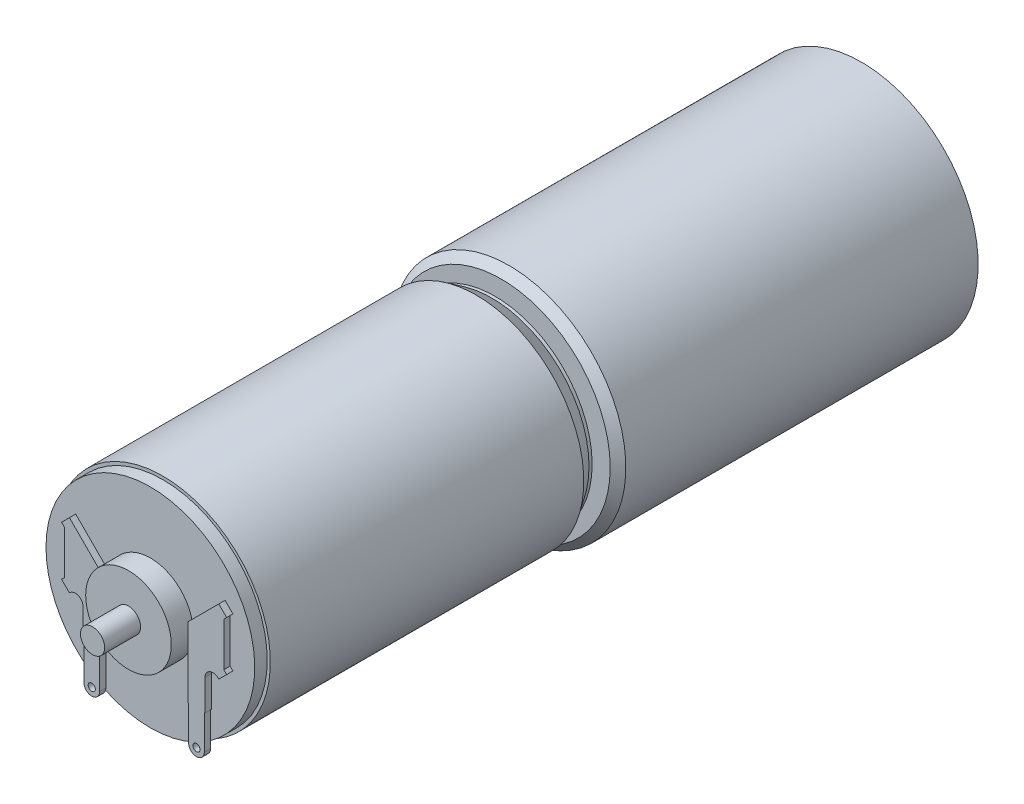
ISO-10303-21;
HEADER;
FILE_DESCRIPTION(('STEP AP214'),'2;1');
FILE_NAME('part.step','',(''),(''),'','','');
FILE_SCHEMA(('AUTOMOTIVE_DESIGN { 1 0 10303 214 1 1 1 1 }'));
ENDSEC;
DATA;
#1=APPLICATION_CONTEXT('core data for automotive mechanical design processes');
#2=APPLICATION_PROTOCOL_DEFINITION('international standard','automotive_design',2000,#1);
#3=PRODUCT_CONTEXT('',#1,'mechanical');
#4=PRODUCT('Part','Part','',(#3));
#5=PRODUCT_RELATED_PRODUCT_CATEGORY('part','',(#4));
#6=PRODUCT_DEFINITION_FORMATION('','',#4);
#7=PRODUCT_DEFINITION_CONTEXT('part definition',#1,'design');
#8=PRODUCT_DEFINITION('design','',#6,#7);
#9=PRODUCT_DEFINITION_SHAPE('','',#8);
#10=(LENGTH_UNIT() NAMED_UNIT(*) SI_UNIT(.MILLI.,.METRE.));
#11=(NAMED_UNIT(*) PLANE_ANGLE_UNIT() SI_UNIT($,.RADIAN.));
#12=(NAMED_UNIT(*) SI_UNIT($,.STERADIAN.) SOLID_ANGLE_UNIT());
#13=UNCERTAINTY_MEASURE_WITH_UNIT(LENGTH_MEASURE(1.E-05),#10,'distance_accuracy_value','');
#14=(GEOMETRIC_REPRESENTATION_CONTEXT(3) GLOBAL_UNCERTAINTY_ASSIGNED_CONTEXT((#13)) GLOBAL_UNIT_ASSIGNED_CONTEXT((#10,
#11,#12)) REPRESENTATION_CONTEXT('',''));
#15=CARTESIAN_POINT('',(0.,0.,0.));
#16=DIRECTION('',(0.,0.,1.));
#17=DIRECTION('',(1.,0.,0.));
#18=AXIS2_PLACEMENT_3D('',#15,#16,#17);
#19=CARTESIAN_POINT('',(0.,6.95959999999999,115.5954));
#20=DIRECTION('',(0.,0.,1.));
#21=DIRECTION('',(1.,0.,0.));
#22=AXIS2_PLACEMENT_3D('',#19,#20,#21);
#23=PLANE('',#22);
#24=CARTESIAN_POINT('',(0.,0.,115.5954));
#25=DIRECTION('',(0.,0.,-1.));
#26=DIRECTION('',(-1.,0.,0.));
#27=AXIS2_PLACEMENT_3D('',#24,#25,#26);
#28=CIRCLE('',#27,6.95959999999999);
#29=CARTESIAN_POINT('',(-6.95959999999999,0.,115.5954));
#30=VERTEX_POINT('',#29);
#31=EDGE_CURVE('E364',#30,#30,#28,.T.);
#32=ORIENTED_EDGE('',*,*,#31,.T.);
#33=EDGE_LOOP('',(#32));
#34=FACE_BOUND('',#33,.T.);
#35=DIRECTION('',(0.,1.,0.));
#36=VECTOR('',#35,1.);
#37=CARTESIAN_POINT('',(-7.24299048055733,-9.39799999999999,115.5954));
#38=LINE('',#37,#36);
#39=CARTESIAN_POINT('',(-7.24299048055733,-14.986,115.5954));
#40=VERTEX_POINT('',#39);
#41=CARTESIAN_POINT('',(-7.24299048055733,-9.39799999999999,115.5954));
#42=VERTEX_POINT('',#41);
#43=EDGE_CURVE('E379',#40,#42,#38,.T.);
#44=ORIENTED_EDGE('',*,*,#43,.F.);
#45=CARTESIAN_POINT('',(-8.51299048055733,-14.986,115.5954));
#46=DIRECTION('',(0.,0.,1.));
#47=DIRECTION('',(-1.,0.,0.));
#48=AXIS2_PLACEMENT_3D('',#45,#46,#47);
#49=CIRCLE('',#48,1.27);
#50=CARTESIAN_POINT('',(-7.28827321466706,-15.3221065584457,115.5954));
#51=VERTEX_POINT('',#50);
#52=EDGE_CURVE('E372',#51,#40,#49,.T.);
#53=ORIENTED_EDGE('',*,*,#52,.F.);
#54=CARTESIAN_POINT('',(0.,0.,115.5954));
#55=DIRECTION('',(0.,0.,-1.));
#56=DIRECTION('',(-1.,0.,0.));
#57=AXIS2_PLACEMENT_3D('',#54,#55,#56);
#58=CIRCLE('',#57,16.9672);
#59=CARTESIAN_POINT('',(7.28827321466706,-15.3221065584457,115.5954));
#60=VERTEX_POINT('',#59);
#61=EDGE_CURVE('E274',#60,#51,#58,.T.);
#62=ORIENTED_EDGE('',*,*,#61,.F.);
#63=CARTESIAN_POINT('',(8.51299048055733,-14.986,115.5954));
#64=DIRECTION('',(0.,0.,1.));
#65=DIRECTION('',(1.,0.,0.));
#66=AXIS2_PLACEMENT_3D('',#63,#64,#65);
#67=CIRCLE('',#66,1.27);
#68=CARTESIAN_POINT('',(7.24299048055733,-14.986,115.5954));
#69=VERTEX_POINT('',#68);
#70=EDGE_CURVE('E495',#69,#60,#67,.T.);
#71=ORIENTED_EDGE('',*,*,#70,.F.);
#72=DIRECTION('',(0.,-1.,0.));
#73=VECTOR('',#72,1.);
#74=CARTESIAN_POINT('',(7.24299048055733,-9.398,115.5954));
#75=LINE('',#74,#73);
#76=CARTESIAN_POINT('',(7.24299048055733,-9.398,115.5954));
#77=VERTEX_POINT('',#76);
#78=EDGE_CURVE('E492',#77,#69,#75,.T.);
#79=ORIENTED_EDGE('',*,*,#78,.F.);
#80=DIRECTION('',(1.,0.,0.));
#81=VECTOR('',#80,1.);
#82=CARTESIAN_POINT('',(7.112,-9.398,115.5954));
#83=LINE('',#82,#81);
#84=CARTESIAN_POINT('',(7.112,-9.398,115.5954));
#85=VERTEX_POINT('',#84);
#86=EDGE_CURVE('E490',#85,#77,#83,.T.);
#87=ORIENTED_EDGE('',*,*,#86,.F.);
#88=DIRECTION('',(0.,-1.,0.));
#89=VECTOR('',#88,1.);
#90=CARTESIAN_POINT('',(7.112,2.032,115.5954));
#91=LINE('',#90,#89);
#92=CARTESIAN_POINT('',(7.112,2.032,115.5954));
#93=VERTEX_POINT('',#92);
#94=EDGE_CURVE('E488',#93,#85,#91,.T.);
#95=ORIENTED_EDGE('',*,*,#94,.F.);
#96=DIRECTION('',(-0.707106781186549,-0.707106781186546,0.));
#97=VECTOR('',#96,1.);
#98=CARTESIAN_POINT('',(12.1409434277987,7.06094342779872,115.5954));
#99=LINE('',#98,#97);
#100=CARTESIAN_POINT('',(12.1409434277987,7.06094342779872,115.5954));
#101=VERTEX_POINT('',#100);
#102=EDGE_CURVE('E486',#101,#93,#99,.T.);
#103=ORIENTED_EDGE('',*,*,#102,.F.);
#104=DIRECTION('',(-0.707106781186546,0.707106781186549,0.));
#105=VECTOR('',#104,1.);
#106=CARTESIAN_POINT('',(12.1409434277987,7.06094342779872,115.5954));
#107=LINE('',#106,#105);
#108=CARTESIAN_POINT('',(13.4161397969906,5.7857470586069,115.5954));
#109=VERTEX_POINT('',#108);
#110=EDGE_CURVE('E483',#109,#101,#107,.T.);
#111=ORIENTED_EDGE('',*,*,#110,.F.);
#112=DIRECTION('',(0.70710678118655,0.707106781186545,0.));
#113=VECTOR('',#112,1.);
#114=CARTESIAN_POINT('',(13.4161397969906,5.7857470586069,115.5954));
#115=LINE('',#114,#113);
#116=CARTESIAN_POINT('',(12.954,5.32360726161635,115.5954));
#117=VERTEX_POINT('',#116);
#118=EDGE_CURVE('E513',#117,#109,#115,.T.);
#119=ORIENTED_EDGE('',*,*,#118,.F.);
#120=DIRECTION('',(0.,1.,0.));
#121=VECTOR('',#120,1.);
#122=CARTESIAN_POINT('',(12.954,5.32360726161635,115.5954));
#123=LINE('',#122,#121);
#124=CARTESIAN_POINT('',(12.954,-1.78839273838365,115.5954));
#125=VERTEX_POINT('',#124);
#126=EDGE_CURVE('E510',#125,#117,#123,.T.);
#127=ORIENTED_EDGE('',*,*,#126,.F.);
#128=DIRECTION('',(-0.707106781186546,0.707106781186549,0.));
#129=VECTOR('',#128,1.);
#130=CARTESIAN_POINT('',(12.954,-1.78839273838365,115.5954));
#131=LINE('',#130,#129);
#132=CARTESIAN_POINT('',(13.4161397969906,-2.2505325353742,115.5954));
#133=VERTEX_POINT('',#132);
#134=EDGE_CURVE('E508',#133,#125,#131,.T.);
#135=ORIENTED_EDGE('',*,*,#134,.F.);
#136=DIRECTION('',(0.707106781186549,0.707106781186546,0.));
#137=VECTOR('',#136,1.);
#138=CARTESIAN_POINT('',(13.4161397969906,-2.2505325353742,115.5954));
#139=LINE('',#138,#137);
#140=CARTESIAN_POINT('',(12.1409434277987,-3.52572890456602,115.5954));
#141=VERTEX_POINT('',#140);
#142=EDGE_CURVE('E506',#141,#133,#139,.T.);
#143=ORIENTED_EDGE('',*,*,#142,.F.);
#144=DIRECTION('',(0.707106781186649,-0.707106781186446,0.));
#145=VECTOR('',#144,1.);
#146=CARTESIAN_POINT('',(12.1409434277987,-3.52572890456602,115.5954));
#147=LINE('',#146,#145);
#148=CARTESIAN_POINT('',(12.0820065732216,-3.46679204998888,115.5954));
#149=VERTEX_POINT('',#148);
#150=EDGE_CURVE('E504',#149,#141,#147,.T.);
#151=ORIENTED_EDGE('',*,*,#150,.F.);
#152=CARTESIAN_POINT('',(11.1839809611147,-4.3648176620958,115.5954));
#153=DIRECTION('',(0.,0.,-1.));
#154=DIRECTION('',(1.,0.,0.));
#155=AXIS2_PLACEMENT_3D('',#152,#153,#154);
#156=CIRCLE('',#155,1.27);
#157=CARTESIAN_POINT('',(9.91398096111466,-4.3648176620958,115.5954));
#158=VERTEX_POINT('',#157);
#159=EDGE_CURVE('E502',#158,#149,#156,.T.);
#160=ORIENTED_EDGE('',*,*,#159,.F.);
#161=DIRECTION('',(0.,1.,0.));
#162=VECTOR('',#161,1.);
#163=CARTESIAN_POINT('',(9.91398096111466,-9.398,115.5954));
#164=LINE('',#163,#162);
#165=CARTESIAN_POINT('',(9.91398096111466,-9.398,115.5954));
#166=VERTEX_POINT('',#165);
#167=EDGE_CURVE('E500',#166,#158,#164,.T.);
#168=ORIENTED_EDGE('',*,*,#167,.F.);
#169=DIRECTION('',(1.,0.,0.));
#170=VECTOR('',#169,1.);
#171=CARTESIAN_POINT('',(9.78299048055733,-9.398,115.5954));
#172=LINE('',#171,#170);
#173=CARTESIAN_POINT('',(9.78299048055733,-9.398,115.5954));
#174=VERTEX_POINT('',#173);
#175=EDGE_CURVE('E317',#174,#166,#172,.T.);
#176=ORIENTED_EDGE('',*,*,#175,.F.);
#177=DIRECTION('',(0.,-1.,0.));
#178=VECTOR('',#177,1.);
#179=CARTESIAN_POINT('',(9.78299048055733,6.95959999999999,115.5954));
#180=LINE('',#179,#178);
#181=CARTESIAN_POINT('',(9.78299048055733,-13.8628630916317,115.5954));
#182=VERTEX_POINT('',#181);
#183=EDGE_CURVE('E36',#174,#182,#180,.T.);
#184=ORIENTED_EDGE('',*,*,#183,.T.);
#185=CARTESIAN_POINT('',(-9.78299048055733,-13.8628630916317,115.5954));
#186=VERTEX_POINT('',#185);
#187=EDGE_CURVE('E265',#186,#182,#58,.T.);
#188=ORIENTED_EDGE('',*,*,#187,.F.);
#189=DIRECTION('',(0.,-1.,0.));
#190=VECTOR('',#189,1.);
#191=CARTESIAN_POINT('',(-9.78299048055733,-14.986,115.5954));
#192=LINE('',#191,#190);
#193=CARTESIAN_POINT('',(-9.78299048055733,-9.39799999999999,115.5954));
#194=VERTEX_POINT('',#193);
#195=EDGE_CURVE('E405',#194,#186,#192,.T.);
#196=ORIENTED_EDGE('',*,*,#195,.F.);
#197=DIRECTION('',(1.,0.,0.));
#198=VECTOR('',#197,1.);
#199=CARTESIAN_POINT('',(-9.78299048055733,-9.39799999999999,115.5954));
#200=LINE('',#199,#198);
#201=CARTESIAN_POINT('',(-9.91398096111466,-9.39799999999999,115.5954));
#202=VERTEX_POINT('',#201);
#203=EDGE_CURVE('E403',#202,#194,#200,.T.);
#204=ORIENTED_EDGE('',*,*,#203,.F.);
#205=DIRECTION('',(0.,-1.,0.));
#206=VECTOR('',#205,1.);
#207=CARTESIAN_POINT('',(-9.91398096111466,-9.39799999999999,115.5954));
#208=LINE('',#207,#206);
#209=CARTESIAN_POINT('',(-9.91398096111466,-4.36481766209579,115.5954));
#210=VERTEX_POINT('',#209);
#211=EDGE_CURVE('E401',#210,#202,#208,.T.);
#212=ORIENTED_EDGE('',*,*,#211,.F.);
#213=CARTESIAN_POINT('',(-11.1839809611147,-4.36481766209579,115.5954));
#214=DIRECTION('',(0.,0.,-1.));
#215=DIRECTION('',(-1.,0.,0.));
#216=AXIS2_PLACEMENT_3D('',#213,#214,#215);
#217=CIRCLE('',#216,1.27);
#218=CARTESIAN_POINT('',(-12.0820065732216,-3.46679204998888,115.5954));
#219=VERTEX_POINT('',#218);
#220=EDGE_CURVE('E399',#219,#210,#217,.T.);
#221=ORIENTED_EDGE('',*,*,#220,.F.);
#222=DIRECTION('',(0.707106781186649,0.707106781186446,0.));
#223=VECTOR('',#222,1.);
#224=CARTESIAN_POINT('',(-12.1409434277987,-3.52572890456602,115.5954));
#225=LINE('',#224,#223);
#226=CARTESIAN_POINT('',(-12.1409434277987,-3.52572890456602,115.5954));
#227=VERTEX_POINT('',#226);
#228=EDGE_CURVE('E397',#227,#219,#225,.T.);
#229=ORIENTED_EDGE('',*,*,#228,.F.);
#230=DIRECTION('',(0.707106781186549,-0.707106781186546,0.));
#231=VECTOR('',#230,1.);
#232=CARTESIAN_POINT('',(-13.4161397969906,-2.2505325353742,115.5954));
#233=LINE('',#232,#231);
#234=CARTESIAN_POINT('',(-13.4161397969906,-2.2505325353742,115.5954));
#235=VERTEX_POINT('',#234);
#236=EDGE_CURVE('E395',#235,#227,#233,.T.);
#237=ORIENTED_EDGE('',*,*,#236,.F.);
#238=DIRECTION('',(-0.707106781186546,-0.707106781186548,0.));
#239=VECTOR('',#238,1.);
#240=CARTESIAN_POINT('',(-12.954,-1.78839273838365,115.5954));
#241=LINE('',#240,#239);
#242=CARTESIAN_POINT('',(-12.954,-1.78839273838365,115.5954));
#243=VERTEX_POINT('',#242);
#244=EDGE_CURVE('E393',#243,#235,#241,.T.);
#245=ORIENTED_EDGE('',*,*,#244,.F.);
#246=DIRECTION('',(0.,-1.,0.));
#247=VECTOR('',#246,1.);
#248=CARTESIAN_POINT('',(-12.954,5.32360726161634,115.5954));
#249=LINE('',#248,#247);
#250=CARTESIAN_POINT('',(-12.954,5.32360726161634,115.5954));
#251=VERTEX_POINT('',#250);
#252=EDGE_CURVE('E391',#251,#243,#249,.T.);
#253=ORIENTED_EDGE('',*,*,#252,.F.);
#254=DIRECTION('',(0.70710678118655,-0.707106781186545,0.));
#255=VECTOR('',#254,1.);
#256=CARTESIAN_POINT('',(-13.4161397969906,5.78574705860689,115.5954));
#257=LINE('',#256,#255);
#258=CARTESIAN_POINT('',(-13.4161397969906,5.78574705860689,115.5954));
#259=VERTEX_POINT('',#258);
#260=EDGE_CURVE('E389',#259,#251,#257,.T.);
#261=ORIENTED_EDGE('',*,*,#260,.F.);
#262=DIRECTION('',(-0.707106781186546,-0.707106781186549,0.));
#263=VECTOR('',#262,1.);
#264=CARTESIAN_POINT('',(-12.1409434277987,7.06094342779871,115.5954));
#265=LINE('',#264,#263);
#266=CARTESIAN_POINT('',(-12.1409434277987,7.06094342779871,115.5954));
#267=VERTEX_POINT('',#266);
#268=EDGE_CURVE('E387',#267,#259,#265,.T.);
#269=ORIENTED_EDGE('',*,*,#268,.F.);
#270=DIRECTION('',(-0.707106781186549,0.707106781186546,0.));
#271=VECTOR('',#270,1.);
#272=CARTESIAN_POINT('',(-12.1409434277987,7.06094342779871,115.5954));
#273=LINE('',#272,#271);
#274=CARTESIAN_POINT('',(-7.112,2.032,115.5954));
#275=VERTEX_POINT('',#274);
#276=EDGE_CURVE('E385',#275,#267,#273,.T.);
#277=ORIENTED_EDGE('',*,*,#276,.F.);
#278=DIRECTION('',(0.,1.,0.));
#279=VECTOR('',#278,1.);
#280=CARTESIAN_POINT('',(-7.112,2.032,115.5954));
#281=LINE('',#280,#279);
#282=CARTESIAN_POINT('',(-7.112,-9.39799999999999,115.5954));
#283=VERTEX_POINT('',#282);
#284=EDGE_CURVE('E383',#283,#275,#281,.T.);
#285=ORIENTED_EDGE('',*,*,#284,.F.);
#286=DIRECTION('',(1.,0.,0.));
#287=VECTOR('',#286,1.);
#288=CARTESIAN_POINT('',(-7.112,-9.39799999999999,115.5954));
#289=LINE('',#288,#287);
#290=EDGE_CURVE('E381',#42,#283,#289,.T.);
#291=ORIENTED_EDGE('',*,*,#290,.F.);
#292=EDGE_LOOP('',(#44,#53,#62,#71,#79,#87,#95,#103,#111,#119,#127,#135,#143,#151,#160,#168,
#176,#184,#188,#196,#204,#212,#221,#229,#237,#245,#253,#261,#269,#277,#285,#291));
#293=FACE_BOUND('',#292,.T.);
#294=ADVANCED_FACE('F28',(#34,#293),#23,.T.);
#295=CARTESIAN_POINT('',(0.,0.,58.547));
#296=DIRECTION('',(0.,0.,1.));
#297=DIRECTION('',(1.,0.,0.));
#298=AXIS2_PLACEMENT_3D('',#295,#296,#297);
#299=PLANE('',#298);
#300=CARTESIAN_POINT('',(0.,0.,58.547));
#301=DIRECTION('',(0.,0.,1.));
#302=DIRECTION('',(1.,0.,0.));
#303=AXIS2_PLACEMENT_3D('',#300,#301,#302);
#304=CIRCLE('',#303,17.7038);
#305=CARTESIAN_POINT('',(17.7038,0.,58.547));
#306=VERTEX_POINT('',#305);
#307=EDGE_CURVE('E306',#306,#306,#304,.T.);
#308=ORIENTED_EDGE('',*,*,#307,.T.);
#309=EDGE_LOOP('',(#308));
#310=FACE_BOUND('',#309,.T.);
#311=CARTESIAN_POINT('',(0.,0.,58.547));
#312=DIRECTION('',(0.,0.,-1.));
#313=DIRECTION('',(-1.,0.,0.));
#314=AXIS2_PLACEMENT_3D('',#311,#312,#313);
#315=CIRCLE('',#314,14.224);
#316=CARTESIAN_POINT('',(-14.224,0.,58.547));
#317=VERTEX_POINT('',#316);
#318=EDGE_CURVE('E300',#317,#317,#315,.T.);
#319=ORIENTED_EDGE('',*,*,#318,.T.);
#320=EDGE_LOOP('',(#319));
#321=FACE_BOUND('',#320,.T.);
#322=ADVANCED_FACE('F595',(#310,#321),#299,.T.);
#323=CARTESIAN_POINT('',(0.,0.,58.547));
#324=DIRECTION('',(0.,0.,-1.));
#325=DIRECTION('',(-1.,0.,0.));
#326=AXIS2_PLACEMENT_3D('',#323,#324,#325);
#327=CYLINDRICAL_SURFACE('',#326,18.9738);
#328=CARTESIAN_POINT('',(0.,0.,57.277));
#329=DIRECTION('',(0.,0.,1.));
#330=DIRECTION('',(1.,0.,0.));
#331=AXIS2_PLACEMENT_3D('',#328,#329,#330);
#332=CIRCLE('',#331,18.9738);
#333=CARTESIAN_POINT('',(-18.9738,0.,57.277));
#334=VERTEX_POINT('',#333);
#335=EDGE_CURVE('E309',#334,#334,#332,.F.);
#336=CARTESIAN_POINT('',(0.,0.,0.));
#337=DIRECTION('',(0.,0.,1.));
#338=DIRECTION('',(1.,0.,0.));
#339=AXIS2_PLACEMENT_3D('',#336,#337,#338);
#340=CIRCLE('',#339,18.9738);
#341=CARTESIAN_POINT('',(-18.9738,0.,0.));
#342=VERTEX_POINT('',#341);
#343=EDGE_CURVE('E303',#342,#342,#340,.T.);
#344=CARTESIAN_POINT('',(-18.9738,0.,57.277));
#345=CARTESIAN_POINT('',(-18.9738,0.,56.6803645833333));
#346=CARTESIAN_POINT('',(-18.9738,0.,56.0837291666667));
#347=CARTESIAN_POINT('',(-18.9738,0.,54.8904583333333));
#348=CARTESIAN_POINT('',(-18.9738,0.,54.2938229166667));
#349=CARTESIAN_POINT('',(-18.9738,0.,53.1005520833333));
#350=CARTESIAN_POINT('',(-18.9738,0.,52.5039166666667));
#351=CARTESIAN_POINT('',(-18.9738,0.,51.3106458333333));
#352=CARTESIAN_POINT('',(-18.9738,0.,50.7140104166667));
#353=CARTESIAN_POINT('',(-18.9738,0.,49.5207395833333));
#354=CARTESIAN_POINT('',(-18.9738,0.,48.9241041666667));
#355=CARTESIAN_POINT('',(-18.9738,0.,47.7308333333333));
#356=CARTESIAN_POINT('',(-18.9738,0.,47.1341979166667));
#357=CARTESIAN_POINT('',(-18.9738,0.,45.9409270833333));
#358=CARTESIAN_POINT('',(-18.9738,0.,45.3442916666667));
#359=CARTESIAN_POINT('',(-18.9738,0.,44.1510208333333));
#360=CARTESIAN_POINT('',(-18.9738,0.,43.5543854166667));
#361=CARTESIAN_POINT('',(-18.9738,0.,42.3611145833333));
#362=CARTESIAN_POINT('',(-18.9738,0.,41.7644791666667));
#363=CARTESIAN_POINT('',(-18.9738,0.,40.5712083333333));
#364=CARTESIAN_POINT('',(-18.9738,0.,39.9745729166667));
#365=CARTESIAN_POINT('',(-18.9738,0.,38.7813020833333));
#366=CARTESIAN_POINT('',(-18.9738,0.,38.1846666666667));
#367=CARTESIAN_POINT('',(-18.9738,0.,36.9913958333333));
#368=CARTESIAN_POINT('',(-18.9738,0.,36.3947604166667));
#369=CARTESIAN_POINT('',(-18.9738,0.,35.2014895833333));
#370=CARTESIAN_POINT('',(-18.9738,0.,34.6048541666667));
#371=CARTESIAN_POINT('',(-18.9738,0.,33.4115833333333));
#372=CARTESIAN_POINT('',(-18.9738,0.,32.8149479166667));
#373=CARTESIAN_POINT('',(-18.9738,0.,31.6216770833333));
#374=CARTESIAN_POINT('',(-18.9738,0.,31.0250416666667));
#375=CARTESIAN_POINT('',(-18.9738,0.,29.8317708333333));
#376=CARTESIAN_POINT('',(-18.9738,0.,29.2351354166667));
#377=CARTESIAN_POINT('',(-18.9738,0.,28.0418645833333));
#378=CARTESIAN_POINT('',(-18.9738,0.,27.4452291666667));
#379=CARTESIAN_POINT('',(-18.9738,0.,26.2519583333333));
#380=CARTESIAN_POINT('',(-18.9738,0.,25.6553229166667));
#381=CARTESIAN_POINT('',(-18.9738,0.,24.4620520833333));
#382=CARTESIAN_POINT('',(-18.9738,0.,23.8654166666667));
#383=CARTESIAN_POINT('',(-18.9738,0.,22.6721458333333));
#384=CARTESIAN_POINT('',(-18.9738,0.,22.0755104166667));
#385=CARTESIAN_POINT('',(-18.9738,0.,20.8822395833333));
#386=CARTESIAN_POINT('',(-18.9738,0.,20.2856041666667));
#387=CARTESIAN_POINT('',(-18.9738,0.,19.0923333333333));
#388=CARTESIAN_POINT('',(-18.9738,0.,18.4956979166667));
#389=CARTESIAN_POINT('',(-18.9738,0.,17.3024270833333));
#390=CARTESIAN_POINT('',(-18.9738,0.,16.7057916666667));
#391=CARTESIAN_POINT('',(-18.9738,0.,15.5125208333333));
#392=CARTESIAN_POINT('',(-18.9738,0.,14.9158854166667));
#393=CARTESIAN_POINT('',(-18.9738,0.,13.7226145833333));
#394=CARTESIAN_POINT('',(-18.9738,0.,13.1259791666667));
#395=CARTESIAN_POINT('',(-18.9738,0.,11.9327083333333));
#396=CARTESIAN_POINT('',(-18.9738,0.,11.3360729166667));
#397=CARTESIAN_POINT('',(-18.9738,0.,10.1428020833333));
#398=CARTESIAN_POINT('',(-18.9738,0.,9.54616666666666));
#399=CARTESIAN_POINT('',(-18.9738,0.,8.35289583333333));
#400=CARTESIAN_POINT('',(-18.9738,0.,7.75626041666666));
#401=CARTESIAN_POINT('',(-18.9738,0.,6.56298958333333));
#402=CARTESIAN_POINT('',(-18.9738,0.,5.96635416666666));
#403=CARTESIAN_POINT('',(-18.9738,0.,4.77308333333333));
#404=CARTESIAN_POINT('',(-18.9738,0.,4.17644791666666));
#405=CARTESIAN_POINT('',(-18.9738,0.,2.98317708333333));
#406=CARTESIAN_POINT('',(-18.9738,0.,2.38654166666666));
#407=CARTESIAN_POINT('',(-18.9738,0.,1.19327083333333));
#408=CARTESIAN_POINT('',(-18.9738,0.,0.596635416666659));
#409=CARTESIAN_POINT('',(-18.9738,0.,0.));
#410=B_SPLINE_CURVE_WITH_KNOTS('',3,(#344,#345,#346,#347,#348,#349,#350,#351,#352,#353,#354,
#355,#356,#357,#358,#359,#360,#361,#362,#363,#364,#365,#366,#367,#368,#369,#370,#371,#372,#373,
#374,#375,#376,#377,#378,#379,#380,#381,#382,#383,#384,#385,#386,#387,#388,#389,#390,#391,#392,
#393,#394,#395,#396,#397,#398,#399,#400,#401,#402,#403,#404,#405,#406,#407,#408,#409),
.UNSPECIFIED.,.F.,.F.,(4,2,2,2,2,2,2,2,2,2,2,2,2,2,2,2,2,2,2,2,2,2,2,2,2,2,2,2,2,2,2,2,4),(0.,
1.78990624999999,3.57981249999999,5.36971875,7.159625,8.94953125,10.7394375,12.52934375,
14.31925,16.10915625,17.8990625,19.68896875,21.478875,23.26878125,25.0586875,26.84859375,
28.6385,30.42840625,32.2183125,34.00821875,35.798125,37.58803125,39.3779375,41.16784375,
42.95775,44.74765625,46.5375625,48.32746875,50.117375,51.90728125,53.6971875,55.48709375,
57.277),.UNSPECIFIED.);
#411=EDGE_CURVE('BSEAM30',#334,#342,#410,.T.);
#412=ORIENTED_EDGE('',*,*,#335,.T.);
#413=ORIENTED_EDGE('',*,*,#343,.T.);
#414=ORIENTED_EDGE('',*,*,#411,.T.);
#415=ORIENTED_EDGE('',*,*,#411,.F.);
#416=EDGE_LOOP('',(#412,#414,#413,#415));
#417=FACE_BOUND('',#416,.T.);
#418=ADVANCED_FACE('F30',(#417),#327,.T.);
#419=CARTESIAN_POINT('',(0.,0.,0.));
#420=DIRECTION('',(0.,0.,1.));
#421=DIRECTION('',(1.,0.,0.));
#422=AXIS2_PLACEMENT_3D('',#419,#420,#421);
#423=PLANE('',#422);
#424=ORIENTED_EDGE('',*,*,#343,.F.);
#425=EDGE_LOOP('',(#424));
#426=FACE_BOUND('',#425,.T.);
#427=ADVANCED_FACE('F629',(#426),#423,.F.);
#428=CARTESIAN_POINT('',(0.,0.,58.547));
#429=DIRECTION('',(0.,0.,-1.));
#430=DIRECTION('',(-1.,0.,0.));
#431=AXIS2_PLACEMENT_3D('',#428,#429,#430);
#432=CONICAL_SURFACE('',#431,17.7038,0.785398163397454);
#433=ORIENTED_EDGE('',*,*,#335,.F.);
#434=EDGE_LOOP('',(#433));
#435=FACE_BOUND('',#434,.T.);
#436=ORIENTED_EDGE('',*,*,#307,.F.);
#437=EDGE_LOOP('',(#436));
#438=FACE_BOUND('',#437,.T.);
#439=ADVANCED_FACE('F625',(#435,#438),#432,.T.);
#440=CARTESIAN_POINT('',(0.,0.,58.547));
#441=DIRECTION('',(0.,0.,1.));
#442=DIRECTION('',(1.,0.,0.));
#443=AXIS2_PLACEMENT_3D('',#440,#441,#442);
#444=CONICAL_SURFACE('',#443,14.224,0.994135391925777);
#445=CARTESIAN_POINT('',(0.,0.,59.563));
#446=DIRECTION('',(0.,0.,-1.));
#447=DIRECTION('',(-1.,0.,0.));
#448=AXIS2_PLACEMENT_3D('',#445,#446,#447);
#449=CIRCLE('',#448,15.7861);
#450=CARTESIAN_POINT('',(-15.7861,0.,59.563));
#451=VERTEX_POINT('',#450);
#452=EDGE_CURVE('E297',#451,#451,#449,.T.);
#453=ORIENTED_EDGE('',*,*,#452,.T.);
#454=EDGE_LOOP('',(#453));
#455=FACE_BOUND('',#454,.T.);
#456=ORIENTED_EDGE('',*,*,#318,.F.);
#457=EDGE_LOOP('',(#456));
#458=FACE_BOUND('',#457,.T.);
#459=ADVANCED_FACE('F621',(#455,#458),#444,.T.);
#460=CARTESIAN_POINT('',(0.,0.,0.));
#461=DIRECTION('',(0.,0.,-1.));
#462=DIRECTION('',(-1.,0.,0.));
#463=AXIS2_PLACEMENT_3D('',#460,#461,#462);
#464=CYLINDRICAL_SURFACE('',#463,15.7861);
#465=CARTESIAN_POINT('',(0.,0.,60.071));
#466=DIRECTION('',(0.,0.,-1.));
#467=DIRECTION('',(-1.,0.,0.));
#468=AXIS2_PLACEMENT_3D('',#465,#466,#467);
#469=CIRCLE('',#468,15.7861);
#470=CARTESIAN_POINT('',(-15.7861,0.,60.071));
#471=VERTEX_POINT('',#470);
#472=EDGE_CURVE('E294',#471,#471,#469,.T.);
#473=ORIENTED_EDGE('',*,*,#472,.T.);
#474=EDGE_LOOP('',(#473));
#475=FACE_BOUND('',#474,.T.);
#476=ORIENTED_EDGE('',*,*,#452,.F.);
#477=EDGE_LOOP('',(#476));
#478=FACE_BOUND('',#477,.T.);
#479=ADVANCED_FACE('F617',(#475,#478),#464,.T.);
#480=CARTESIAN_POINT('',(0.,0.,60.071));
#481=DIRECTION('',(0.,0.,1.));
#482=DIRECTION('',(1.,0.,0.));
#483=AXIS2_PLACEMENT_3D('',#480,#481,#482);
#484=CONICAL_SURFACE('',#483,15.7861,0.586847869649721);
#485=CARTESIAN_POINT('',(0.,0.,62.611));
#486=DIRECTION('',(0.,0.,-1.));
#487=DIRECTION('',(-1.,0.,0.));
#488=AXIS2_PLACEMENT_3D('',#485,#486,#487);
#489=CIRCLE('',#488,17.4752);
#490=CARTESIAN_POINT('',(-17.4752,0.,62.611));
#491=VERTEX_POINT('',#490);
#492=EDGE_CURVE('E289',#491,#491,#489,.T.);
#493=ORIENTED_EDGE('',*,*,#492,.T.);
#494=EDGE_LOOP('',(#493));
#495=FACE_BOUND('',#494,.T.);
#496=ORIENTED_EDGE('',*,*,#472,.F.);
#497=EDGE_LOOP('',(#496));
#498=FACE_BOUND('',#497,.T.);
#499=ADVANCED_FACE('F613',(#495,#498),#484,.T.);
#500=CARTESIAN_POINT('',(0.,0.,0.));
#501=DIRECTION('',(0.,0.,-1.));
#502=DIRECTION('',(-1.,0.,0.));
#503=AXIS2_PLACEMENT_3D('',#500,#501,#502);
#504=CYLINDRICAL_SURFACE('',#503,17.4752);
#505=CARTESIAN_POINT('',(0.,0.,113.5634));
#506=DIRECTION('',(0.,0.,-1.));
#507=DIRECTION('',(-1.,0.,0.));
#508=AXIS2_PLACEMENT_3D('',#505,#506,#507);
#509=CIRCLE('',#508,17.4752);
#510=CARTESIAN_POINT('',(-17.4752,0.,113.5634));
#511=VERTEX_POINT('',#510);
#512=EDGE_CURVE('E285',#511,#511,#509,.T.);
#513=ORIENTED_EDGE('',*,*,#512,.T.);
#514=EDGE_LOOP('',(#513));
#515=FACE_BOUND('',#514,.T.);
#516=ORIENTED_EDGE('',*,*,#492,.F.);
#517=EDGE_LOOP('',(#516));
#518=FACE_BOUND('',#517,.T.);
#519=ADVANCED_FACE('F610',(#515,#518),#504,.T.);
#520=CARTESIAN_POINT('',(0.,17.4752,113.5634));
#521=DIRECTION('',(0.,0.,1.));
#522=DIRECTION('',(1.,0.,0.));
#523=AXIS2_PLACEMENT_3D('',#520,#521,#522);
#524=PLANE('',#523);
#525=CARTESIAN_POINT('',(0.,0.,113.5634));
#526=DIRECTION('',(0.,0.,-1.));
#527=DIRECTION('',(-1.,0.,0.));
#528=AXIS2_PLACEMENT_3D('',#525,#526,#527);
#529=CIRCLE('',#528,16.9672);
#530=CARTESIAN_POINT('',(-16.9672,0.,113.5634));
#531=VERTEX_POINT('',#530);
#532=EDGE_CURVE('E282',#531,#531,#529,.T.);
#533=ORIENTED_EDGE('',*,*,#532,.T.);
#534=EDGE_LOOP('',(#533));
#535=FACE_BOUND('',#534,.T.);
#536=ORIENTED_EDGE('',*,*,#512,.F.);
#537=EDGE_LOOP('',(#536));
#538=FACE_BOUND('',#537,.T.);
#539=ADVANCED_FACE('F607',(#535,#538),#524,.T.);
#540=CARTESIAN_POINT('',(0.,0.,0.));
#541=DIRECTION('',(0.,0.,-1.));
#542=DIRECTION('',(-1.,0.,0.));
#543=AXIS2_PLACEMENT_3D('',#540,#541,#542);
#544=CYLINDRICAL_SURFACE('',#543,16.9672);
#545=CARTESIAN_POINT('',(8.82167477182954,-14.4935823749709,115.5954));
#546=VERTEX_POINT('',#545);
#547=EDGE_CURVE('E267',#182,#546,#58,.T.);
#548=ORIENTED_EDGE('',*,*,#547,.T.);
#549=CARTESIAN_POINT('',(7.9319635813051,-14.9989942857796,115.5954));
#550=VERTEX_POINT('',#549);
#551=EDGE_CURVE('E277',#546,#550,#58,.T.);
#552=ORIENTED_EDGE('',*,*,#551,.T.);
#553=EDGE_CURVE('E273',#550,#60,#58,.T.);
#554=ORIENTED_EDGE('',*,*,#553,.T.);
#555=ORIENTED_EDGE('',*,*,#61,.T.);
#556=CARTESIAN_POINT('',(-7.93196358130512,-14.9989942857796,115.5954));
#557=VERTEX_POINT('',#556);
#558=EDGE_CURVE('E272',#51,#557,#58,.T.);
#559=ORIENTED_EDGE('',*,*,#558,.T.);
#560=CARTESIAN_POINT('',(-8.82167477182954,-14.4935823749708,115.5954));
#561=VERTEX_POINT('',#560);
#562=EDGE_CURVE('E253',#557,#561,#58,.T.);
#563=ORIENTED_EDGE('',*,*,#562,.T.);
#564=EDGE_CURVE('E258',#561,#186,#58,.T.);
#565=ORIENTED_EDGE('',*,*,#564,.T.);
#566=ORIENTED_EDGE('',*,*,#187,.T.);
#567=EDGE_LOOP('',(#548,#552,#554,#555,#559,#563,#565,#566));
#568=FACE_BOUND('',#567,.T.);
#569=ORIENTED_EDGE('',*,*,#532,.F.);
#570=EDGE_LOOP('',(#569));
#571=FACE_BOUND('',#570,.T.);
#572=ADVANCED_FACE('F269',(#568,#571),#544,.T.);
#573=CARTESIAN_POINT('',(0.,0.,0.));
#574=DIRECTION('',(0.,0.,-1.));
#575=DIRECTION('',(-1.,0.,0.));
#576=AXIS2_PLACEMENT_3D('',#573,#574,#575);
#577=CYLINDRICAL_SURFACE('',#576,6.95959999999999);
#578=CARTESIAN_POINT('',(0.,0.,119.1514));
#579=DIRECTION('',(0.,0.,-1.));
#580=DIRECTION('',(-1.,0.,0.));
#581=AXIS2_PLACEMENT_3D('',#578,#579,#580);
#582=CIRCLE('',#581,6.95959999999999);
#583=CARTESIAN_POINT('',(-6.95959999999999,0.,119.1514));
#584=VERTEX_POINT('',#583);
#585=EDGE_CURVE('E362',#584,#584,#582,.T.);
#586=ORIENTED_EDGE('',*,*,#585,.T.);
#587=EDGE_LOOP('',(#586));
#588=FACE_BOUND('',#587,.T.);
#589=ORIENTED_EDGE('',*,*,#31,.F.);
#590=EDGE_LOOP('',(#589));
#591=FACE_BOUND('',#590,.T.);
#592=ADVANCED_FACE('F603',(#588,#591),#577,.T.);
#593=CARTESIAN_POINT('',(0.,1.96849999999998,119.1514));
#594=DIRECTION('',(0.,0.,1.));
#595=DIRECTION('',(1.,0.,0.));
#596=AXIS2_PLACEMENT_3D('',#593,#594,#595);
#597=PLANE('',#596);
#598=CARTESIAN_POINT('',(0.,0.,119.1514));
#599=DIRECTION('',(0.,0.,-1.));
#600=DIRECTION('',(-1.,0.,0.));
#601=AXIS2_PLACEMENT_3D('',#598,#599,#600);
#602=CIRCLE('',#601,1.96849999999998);
#603=CARTESIAN_POINT('',(-1.96849999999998,0.,119.1514));
#604=VERTEX_POINT('',#603);
#605=EDGE_CURVE('E359',#604,#604,#602,.T.);
#606=ORIENTED_EDGE('',*,*,#605,.T.);
#607=EDGE_LOOP('',(#606));
#608=FACE_BOUND('',#607,.T.);
#609=ORIENTED_EDGE('',*,*,#585,.F.);
#610=EDGE_LOOP('',(#609));
#611=FACE_BOUND('',#610,.T.);
#612=ADVANCED_FACE('F1100',(#608,#611),#597,.T.);
#613=CARTESIAN_POINT('',(0.,0.,0.));
#614=DIRECTION('',(0.,0.,-1.));
#615=DIRECTION('',(-1.,0.,0.));
#616=AXIS2_PLACEMENT_3D('',#613,#614,#615);
#617=CYLINDRICAL_SURFACE('',#616,1.96849999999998);
#618=CARTESIAN_POINT('',(0.,0.,124.9934));
#619=DIRECTION('',(0.,0.,-1.));
#620=DIRECTION('',(-1.,0.,0.));
#621=AXIS2_PLACEMENT_3D('',#618,#619,#620);
#622=CIRCLE('',#621,1.96849999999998);
#623=CARTESIAN_POINT('',(-1.96849999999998,0.,124.9934));
#624=VERTEX_POINT('',#623);
#625=EDGE_CURVE('E356',#624,#624,#622,.T.);
#626=ORIENTED_EDGE('',*,*,#625,.T.);
#627=EDGE_LOOP('',(#626));
#628=FACE_BOUND('',#627,.T.);
#629=ORIENTED_EDGE('',*,*,#605,.F.);
#630=EDGE_LOOP('',(#629));
#631=FACE_BOUND('',#630,.T.);
#632=ADVANCED_FACE('F1093',(#628,#631),#617,.T.);
#633=CARTESIAN_POINT('',(0.,1.96849999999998,124.9934));
#634=DIRECTION('',(0.,0.,1.));
#635=DIRECTION('',(1.,0.,0.));
#636=AXIS2_PLACEMENT_3D('',#633,#634,#635);
#637=PLANE('',#636);
#638=ORIENTED_EDGE('',*,*,#625,.F.);
#639=EDGE_LOOP('',(#638));
#640=FACE_BOUND('',#639,.T.);
#641=ADVANCED_FACE('F663',(#640),#637,.T.);
#642=CARTESIAN_POINT('',(12.1409434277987,7.06094342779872,116.6114));
#643=DIRECTION('',(-0.707106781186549,-0.707106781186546,0.));
#644=DIRECTION('',(0.707106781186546,-0.707106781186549,0.));
#645=AXIS2_PLACEMENT_3D('',#642,#643,#644);
#646=PLANE('',#645);
#647=ORIENTED_EDGE('',*,*,#110,.T.);
#648=DIRECTION('',(0.,0.,-1.));
#649=VECTOR('',#648,1.);
#650=CARTESIAN_POINT('',(12.1409434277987,7.06094342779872,116.6114));
#651=LINE('',#650,#649);
#652=CARTESIAN_POINT('',(12.1409434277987,7.06094342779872,116.6114));
#653=VERTEX_POINT('',#652);
#654=EDGE_CURVE('E354',#653,#101,#651,.T.);
#655=ORIENTED_EDGE('',*,*,#654,.F.);
#656=DIRECTION('',(-0.707106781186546,0.707106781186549,0.));
#657=VECTOR('',#656,1.);
#658=CARTESIAN_POINT('',(12.1409434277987,7.06094342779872,116.6114));
#659=LINE('',#658,#657);
#660=CARTESIAN_POINT('',(13.4161397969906,5.7857470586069,116.6114));
#661=VERTEX_POINT('',#660);
#662=EDGE_CURVE('E515',#661,#653,#659,.T.);
#663=ORIENTED_EDGE('',*,*,#662,.F.);
#664=DIRECTION('',(0.,0.,-1.));
#665=VECTOR('',#664,1.);
#666=CARTESIAN_POINT('',(13.4161397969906,5.7857470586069,116.6114));
#667=LINE('',#666,#665);
#668=EDGE_CURVE('E545',#661,#109,#667,.T.);
#669=ORIENTED_EDGE('',*,*,#668,.T.);
#670=EDGE_LOOP('',(#647,#655,#663,#669));
#671=FACE_BOUND('',#670,.T.);
#672=ADVANCED_FACE('F668',(#671),#646,.F.);
#673=CARTESIAN_POINT('',(12.1409434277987,7.06094342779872,116.6114));
#674=DIRECTION('',(0.707106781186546,-0.707106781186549,0.));
#675=DIRECTION('',(0.707106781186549,0.707106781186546,0.));
#676=AXIS2_PLACEMENT_3D('',#673,#674,#675);
#677=PLANE('',#676);
#678=ORIENTED_EDGE('',*,*,#102,.T.);
#679=DIRECTION('',(0.,0.,-1.));
#680=VECTOR('',#679,1.);
#681=CARTESIAN_POINT('',(7.112,2.032,116.6114));
#682=LINE('',#681,#680);
#683=CARTESIAN_POINT('',(7.112,2.032,116.6114));
#684=VERTEX_POINT('',#683);
#685=EDGE_CURVE('E351',#684,#93,#682,.T.);
#686=ORIENTED_EDGE('',*,*,#685,.F.);
#687=DIRECTION('',(-0.707106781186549,-0.707106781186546,0.));
#688=VECTOR('',#687,1.);
#689=CARTESIAN_POINT('',(12.1409434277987,7.06094342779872,116.6114));
#690=LINE('',#689,#688);
#691=EDGE_CURVE('E518',#653,#684,#690,.T.);
#692=ORIENTED_EDGE('',*,*,#691,.F.);
#693=ORIENTED_EDGE('',*,*,#654,.T.);
#694=EDGE_LOOP('',(#678,#686,#692,#693));
#695=FACE_BOUND('',#694,.T.);
#696=ADVANCED_FACE('F674',(#695),#677,.F.);
#697=CARTESIAN_POINT('',(7.112,2.032,116.6114));
#698=DIRECTION('',(1.,0.,0.));
#699=DIRECTION('',(0.,1.,0.));
#700=AXIS2_PLACEMENT_3D('',#697,#698,#699);
#701=PLANE('',#700);
#702=ORIENTED_EDGE('',*,*,#94,.T.);
#703=DIRECTION('',(0.,0.,-1.));
#704=VECTOR('',#703,1.);
#705=CARTESIAN_POINT('',(7.112,-9.398,116.6114));
#706=LINE('',#705,#704);
#707=CARTESIAN_POINT('',(7.112,-9.398,116.6114));
#708=VERTEX_POINT('',#707);
#709=EDGE_CURVE('E348',#708,#85,#706,.T.);
#710=ORIENTED_EDGE('',*,*,#709,.F.);
#711=DIRECTION('',(0.,-1.,0.));
#712=VECTOR('',#711,1.);
#713=CARTESIAN_POINT('',(7.112,2.032,116.6114));
#714=LINE('',#713,#712);
#715=EDGE_CURVE('E520',#684,#708,#714,.T.);
#716=ORIENTED_EDGE('',*,*,#715,.F.);
#717=ORIENTED_EDGE('',*,*,#685,.T.);
#718=EDGE_LOOP('',(#702,#710,#716,#717));
#719=FACE_BOUND('',#718,.T.);
#720=ADVANCED_FACE('F683',(#719),#701,.F.);
#721=CARTESIAN_POINT('',(7.112,-9.398,116.6114));
#722=DIRECTION('',(0.,1.,0.));
#723=DIRECTION('',(-1.,0.,0.));
#724=AXIS2_PLACEMENT_3D('',#721,#722,#723);
#725=PLANE('',#724);
#726=ORIENTED_EDGE('',*,*,#86,.T.);
#727=DIRECTION('',(0.,0.,-1.));
#728=VECTOR('',#727,1.);
#729=CARTESIAN_POINT('',(7.24299048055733,-9.398,116.6114));
#730=LINE('',#729,#728);
#731=CARTESIAN_POINT('',(7.24299048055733,-9.398,116.6114));
#732=VERTEX_POINT('',#731);
#733=EDGE_CURVE('E345',#732,#77,#730,.T.);
#734=ORIENTED_EDGE('',*,*,#733,.F.);
#735=DIRECTION('',(1.,0.,0.));
#736=VECTOR('',#735,1.);
#737=CARTESIAN_POINT('',(7.112,-9.398,116.6114));
#738=LINE('',#737,#736);
#739=EDGE_CURVE('E522',#708,#732,#738,.T.);
#740=ORIENTED_EDGE('',*,*,#739,.F.);
#741=ORIENTED_EDGE('',*,*,#709,.T.);
#742=EDGE_LOOP('',(#726,#734,#740,#741));
#743=FACE_BOUND('',#742,.T.);
#744=ADVANCED_FACE('F692',(#743),#725,.F.);
#745=CARTESIAN_POINT('',(7.24299048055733,-9.398,116.6114));
#746=DIRECTION('',(1.,0.,0.));
#747=DIRECTION('',(0.,1.,0.));
#748=AXIS2_PLACEMENT_3D('',#745,#746,#747);
#749=PLANE('',#748);
#750=ORIENTED_EDGE('',*,*,#78,.T.);
#751=DIRECTION('',(0.,0.,-1.));
#752=VECTOR('',#751,1.);
#753=CARTESIAN_POINT('',(7.24299048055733,-14.986,116.6114));
#754=LINE('',#753,#752);
#755=CARTESIAN_POINT('',(7.24299048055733,-14.986,116.6114));
#756=VERTEX_POINT('',#755);
#757=EDGE_CURVE('E337',#756,#69,#754,.T.);
#758=ORIENTED_EDGE('',*,*,#757,.F.);
#759=DIRECTION('',(0.,-1.,0.));
#760=VECTOR('',#759,1.);
#761=CARTESIAN_POINT('',(7.24299048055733,-9.398,116.6114));
#762=LINE('',#761,#760);
#763=EDGE_CURVE('E524',#732,#756,#762,.T.);
#764=ORIENTED_EDGE('',*,*,#763,.F.);
#765=ORIENTED_EDGE('',*,*,#733,.T.);
#766=EDGE_LOOP('',(#750,#758,#764,#765));
#767=FACE_BOUND('',#766,.T.);
#768=ADVANCED_FACE('F701',(#767),#749,.F.);
#769=CARTESIAN_POINT('',(8.51299048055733,-14.986,116.6114));
#770=DIRECTION('',(0.,0.,-1.));
#771=DIRECTION('',(-1.,0.,0.));
#772=AXIS2_PLACEMENT_3D('',#769,#770,#771);
#773=CYLINDRICAL_SURFACE('',#772,1.27);
#774=ORIENTED_EDGE('',*,*,#70,.T.);
#775=CARTESIAN_POINT('',(9.78299048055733,-14.986,115.5954));
#776=VERTEX_POINT('',#775);
#777=EDGE_CURVE('E494',#60,#776,#67,.T.);
#778=ORIENTED_EDGE('',*,*,#777,.T.);
#779=DIRECTION('',(0.,0.,-1.));
#780=VECTOR('',#779,1.);
#781=CARTESIAN_POINT('',(9.78299048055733,-14.986,116.6114));
#782=LINE('',#781,#780);
#783=CARTESIAN_POINT('',(9.78299048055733,-14.986,116.6114));
#784=VERTEX_POINT('',#783);
#785=EDGE_CURVE('E334',#784,#776,#782,.T.);
#786=ORIENTED_EDGE('',*,*,#785,.F.);
#787=CARTESIAN_POINT('',(8.51299048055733,-14.986,116.6114));
#788=DIRECTION('',(0.,0.,1.));
#789=DIRECTION('',(1.,0.,0.));
#790=AXIS2_PLACEMENT_3D('',#787,#788,#789);
#791=CIRCLE('',#790,1.27);
#792=EDGE_CURVE('E526',#756,#784,#791,.T.);
#793=ORIENTED_EDGE('',*,*,#792,.F.);
#794=ORIENTED_EDGE('',*,*,#757,.T.);
#795=EDGE_LOOP('',(#774,#778,#786,#793,#794));
#796=FACE_BOUND('',#795,.T.);
#797=ADVANCED_FACE('F710',(#796),#773,.T.);
#798=CARTESIAN_POINT('',(9.78299048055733,-14.986,116.6114));
#799=DIRECTION('',(-1.,0.,0.));
#800=DIRECTION('',(0.,0.,1.));
#801=AXIS2_PLACEMENT_3D('',#798,#799,#800);
#802=PLANE('',#801);
#803=DIRECTION('',(0.,1.,0.));
#804=VECTOR('',#803,1.);
#805=CARTESIAN_POINT('',(9.78299048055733,-14.986,115.5954));
#806=LINE('',#805,#804);
#807=EDGE_CURVE('E328',#776,#182,#806,.T.);
#808=ORIENTED_EDGE('',*,*,#807,.T.);
#809=ORIENTED_EDGE('',*,*,#183,.F.);
#810=DIRECTION('',(0.,0.,-1.));
#811=VECTOR('',#810,1.);
#812=CARTESIAN_POINT('',(9.78299048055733,-9.398,116.6114));
#813=LINE('',#812,#811);
#814=CARTESIAN_POINT('',(9.78299048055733,-9.398,116.6114));
#815=VERTEX_POINT('',#814);
#816=EDGE_CURVE('E324',#815,#174,#813,.T.);
#817=ORIENTED_EDGE('',*,*,#816,.F.);
#818=DIRECTION('',(0.,1.,0.));
#819=VECTOR('',#818,1.);
#820=CARTESIAN_POINT('',(9.78299048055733,-14.986,116.6114));
#821=LINE('',#820,#819);
#822=EDGE_CURVE('E528',#784,#815,#821,.T.);
#823=ORIENTED_EDGE('',*,*,#822,.F.);
#824=ORIENTED_EDGE('',*,*,#785,.T.);
#825=EDGE_LOOP('',(#808,#809,#817,#823,#824));
#826=FACE_BOUND('',#825,.T.);
#827=ADVANCED_FACE('F322',(#826),#802,.F.);
#828=CARTESIAN_POINT('',(9.78299048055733,-9.398,116.6114));
#829=DIRECTION('',(0.,1.,0.));
#830=DIRECTION('',(0.,0.,1.));
#831=AXIS2_PLACEMENT_3D('',#828,#829,#830);
#832=PLANE('',#831);
#833=ORIENTED_EDGE('',*,*,#175,.T.);
#834=DIRECTION('',(0.,0.,-1.));
#835=VECTOR('',#834,1.);
#836=CARTESIAN_POINT('',(9.91398096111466,-9.398,116.6114));
#837=LINE('',#836,#835);
#838=CARTESIAN_POINT('',(9.91398096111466,-9.398,116.6114));
#839=VERTEX_POINT('',#838);
#840=EDGE_CURVE('E335',#839,#166,#837,.T.);
#841=ORIENTED_EDGE('',*,*,#840,.F.);
#842=DIRECTION('',(1.,0.,0.));
#843=VECTOR('',#842,1.);
#844=CARTESIAN_POINT('',(9.78299048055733,-9.398,116.6114));
#845=LINE('',#844,#843);
#846=EDGE_CURVE('E333',#815,#839,#845,.T.);
#847=ORIENTED_EDGE('',*,*,#846,.F.);
#848=ORIENTED_EDGE('',*,*,#816,.T.);
#849=EDGE_LOOP('',(#833,#841,#847,#848));
#850=FACE_BOUND('',#849,.T.);
#851=ADVANCED_FACE('F330',(#850),#832,.F.);
#852=CARTESIAN_POINT('',(9.91398096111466,-9.398,116.6114));
#853=DIRECTION('',(-1.,0.,0.));
#854=DIRECTION('',(0.,0.,1.));
#855=AXIS2_PLACEMENT_3D('',#852,#853,#854);
#856=PLANE('',#855);
#857=ORIENTED_EDGE('',*,*,#167,.T.);
#858=DIRECTION('',(0.,0.,-1.));
#859=VECTOR('',#858,1.);
#860=CARTESIAN_POINT('',(9.91398096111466,-4.3648176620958,116.6114));
#861=LINE('',#860,#859);
#862=CARTESIAN_POINT('',(9.91398096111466,-4.3648176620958,116.6114));
#863=VERTEX_POINT('',#862);
#864=EDGE_CURVE('E339',#863,#158,#861,.T.);
#865=ORIENTED_EDGE('',*,*,#864,.F.);
#866=DIRECTION('',(0.,1.,0.));
#867=VECTOR('',#866,1.);
#868=CARTESIAN_POINT('',(9.91398096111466,-9.398,116.6114));
#869=LINE('',#868,#867);
#870=EDGE_CURVE('E531',#839,#863,#869,.T.);
#871=ORIENTED_EDGE('',*,*,#870,.F.);
#872=ORIENTED_EDGE('',*,*,#840,.T.);
#873=EDGE_LOOP('',(#857,#865,#871,#872));
#874=FACE_BOUND('',#873,.T.);
#875=ADVANCED_FACE('F585',(#874),#856,.F.);
#876=CARTESIAN_POINT('',(11.1839809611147,-4.3648176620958,116.6114));
#877=DIRECTION('',(0.,0.,-1.));
#878=DIRECTION('',(-1.,0.,0.));
#879=AXIS2_PLACEMENT_3D('',#876,#877,#878);
#880=CYLINDRICAL_SURFACE('',#879,1.27);
#881=ORIENTED_EDGE('',*,*,#159,.T.);
#882=DIRECTION('',(0.,0.,-1.));
#883=VECTOR('',#882,1.);
#884=CARTESIAN_POINT('',(12.0820065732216,-3.46679204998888,116.6114));
#885=LINE('',#884,#883);
#886=CARTESIAN_POINT('',(12.0820065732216,-3.46679204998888,116.6114));
#887=VERTEX_POINT('',#886);
#888=EDGE_CURVE('E559',#887,#149,#885,.T.);
#889=ORIENTED_EDGE('',*,*,#888,.F.);
#890=CARTESIAN_POINT('',(11.1839809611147,-4.3648176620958,116.6114));
#891=DIRECTION('',(0.,0.,-1.));
#892=DIRECTION('',(1.,0.,0.));
#893=AXIS2_PLACEMENT_3D('',#890,#891,#892);
#894=CIRCLE('',#893,1.27);
#895=EDGE_CURVE('E533',#863,#887,#894,.T.);
#896=ORIENTED_EDGE('',*,*,#895,.F.);
#897=ORIENTED_EDGE('',*,*,#864,.T.);
#898=EDGE_LOOP('',(#881,#889,#896,#897));
#899=FACE_BOUND('',#898,.T.);
#900=ADVANCED_FACE('F566',(#899),#880,.F.);
#901=CARTESIAN_POINT('',(12.1409434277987,-3.52572890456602,116.6114));
#902=DIRECTION('',(0.707106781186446,0.707106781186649,0.));
#903=DIRECTION('',(-0.707106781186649,0.707106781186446,0.));
#904=AXIS2_PLACEMENT_3D('',#901,#902,#903);
#905=PLANE('',#904);
#906=ORIENTED_EDGE('',*,*,#150,.T.);
#907=DIRECTION('',(0.,0.,-1.));
#908=VECTOR('',#907,1.);
#909=CARTESIAN_POINT('',(12.1409434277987,-3.52572890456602,116.6114));
#910=LINE('',#909,#908);
#911=CARTESIAN_POINT('',(12.1409434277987,-3.52572890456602,116.6114));
#912=VERTEX_POINT('',#911);
#913=EDGE_CURVE('E556',#912,#141,#910,.T.);
#914=ORIENTED_EDGE('',*,*,#913,.F.);
#915=DIRECTION('',(0.707106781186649,-0.707106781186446,0.));
#916=VECTOR('',#915,1.);
#917=CARTESIAN_POINT('',(12.1409434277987,-3.52572890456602,116.6114));
#918=LINE('',#917,#916);
#919=EDGE_CURVE('E535',#887,#912,#918,.T.);
#920=ORIENTED_EDGE('',*,*,#919,.F.);
#921=ORIENTED_EDGE('',*,*,#888,.T.);
#922=EDGE_LOOP('',(#906,#914,#920,#921));
#923=FACE_BOUND('',#922,.T.);
#924=ADVANCED_FACE('F575',(#923),#905,.F.);
#925=CARTESIAN_POINT('',(13.4161397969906,-2.2505325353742,116.6114));
#926=DIRECTION('',(-0.707106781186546,0.707106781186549,0.));
#927=DIRECTION('',(-0.707106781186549,-0.707106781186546,0.));
#928=AXIS2_PLACEMENT_3D('',#925,#926,#927);
#929=PLANE('',#928);
#930=ORIENTED_EDGE('',*,*,#142,.T.);
#931=DIRECTION('',(0.,0.,-1.));
#932=VECTOR('',#931,1.);
#933=CARTESIAN_POINT('',(13.4161397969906,-2.2505325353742,116.6114));
#934=LINE('',#933,#932);
#935=CARTESIAN_POINT('',(13.4161397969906,-2.2505325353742,116.6114));
#936=VERTEX_POINT('',#935);
#937=EDGE_CURVE('E553',#936,#133,#934,.T.);
#938=ORIENTED_EDGE('',*,*,#937,.F.);
#939=DIRECTION('',(0.707106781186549,0.707106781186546,0.));
#940=VECTOR('',#939,1.);
#941=CARTESIAN_POINT('',(13.4161397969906,-2.2505325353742,116.6114));
#942=LINE('',#941,#940);
#943=EDGE_CURVE('E537',#912,#936,#942,.T.);
#944=ORIENTED_EDGE('',*,*,#943,.F.);
#945=ORIENTED_EDGE('',*,*,#913,.T.);
#946=EDGE_LOOP('',(#930,#938,#944,#945));
#947=FACE_BOUND('',#946,.T.);
#948=ADVANCED_FACE('F579',(#947),#929,.F.);
#949=CARTESIAN_POINT('',(12.954,-1.78839273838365,116.6114));
#950=DIRECTION('',(-0.707106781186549,-0.707106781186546,0.));
#951=DIRECTION('',(0.707106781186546,-0.707106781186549,0.));
#952=AXIS2_PLACEMENT_3D('',#949,#950,#951);
#953=PLANE('',#952);
#954=ORIENTED_EDGE('',*,*,#134,.T.);
#955=DIRECTION('',(0.,0.,-1.));
#956=VECTOR('',#955,1.);
#957=CARTESIAN_POINT('',(12.954,-1.78839273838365,116.6114));
#958=LINE('',#957,#956);
#959=CARTESIAN_POINT('',(12.954,-1.78839273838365,116.6114));
#960=VERTEX_POINT('',#959);
#961=EDGE_CURVE('E550',#960,#125,#958,.T.);
#962=ORIENTED_EDGE('',*,*,#961,.F.);
#963=DIRECTION('',(-0.707106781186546,0.707106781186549,0.));
#964=VECTOR('',#963,1.);
#965=CARTESIAN_POINT('',(12.954,-1.78839273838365,116.6114));
#966=LINE('',#965,#964);
#967=EDGE_CURVE('E539',#936,#960,#966,.T.);
#968=ORIENTED_EDGE('',*,*,#967,.F.);
#969=ORIENTED_EDGE('',*,*,#937,.T.);
#970=EDGE_LOOP('',(#954,#962,#968,#969));
#971=FACE_BOUND('',#970,.T.);
#972=ADVANCED_FACE('F755',(#971),#953,.F.);
#973=CARTESIAN_POINT('',(12.954,5.32360726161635,116.6114));
#974=DIRECTION('',(-1.,0.,0.));
#975=DIRECTION('',(0.,-1.,0.));
#976=AXIS2_PLACEMENT_3D('',#973,#974,#975);
#977=PLANE('',#976);
#978=ORIENTED_EDGE('',*,*,#126,.T.);
#979=DIRECTION('',(0.,0.,-1.));
#980=VECTOR('',#979,1.);
#981=CARTESIAN_POINT('',(12.954,5.32360726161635,116.6114));
#982=LINE('',#981,#980);
#983=CARTESIAN_POINT('',(12.954,5.32360726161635,116.6114));
#984=VERTEX_POINT('',#983);
#985=EDGE_CURVE('E548',#984,#117,#982,.T.);
#986=ORIENTED_EDGE('',*,*,#985,.F.);
#987=DIRECTION('',(0.,1.,0.));
#988=VECTOR('',#987,1.);
#989=CARTESIAN_POINT('',(12.954,5.32360726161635,116.6114));
#990=LINE('',#989,#988);
#991=EDGE_CURVE('E541',#960,#984,#990,.T.);
#992=ORIENTED_EDGE('',*,*,#991,.F.);
#993=ORIENTED_EDGE('',*,*,#961,.T.);
#994=EDGE_LOOP('',(#978,#986,#992,#993));
#995=FACE_BOUND('',#994,.T.);
#996=ADVANCED_FACE('F763',(#995),#977,.F.);
#997=CARTESIAN_POINT('',(13.4161397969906,5.7857470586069,116.6114));
#998=DIRECTION('',(-0.707106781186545,0.70710678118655,0.));
#999=DIRECTION('',(-0.70710678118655,-0.707106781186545,0.));
#1000=AXIS2_PLACEMENT_3D('',#997,#998,#999);
#1001=PLANE('',#1000);
#1002=ORIENTED_EDGE('',*,*,#118,.T.);
#1003=ORIENTED_EDGE('',*,*,#668,.F.);
#1004=DIRECTION('',(0.70710678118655,0.707106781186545,0.));
#1005=VECTOR('',#1004,1.);
#1006=CARTESIAN_POINT('',(13.4161397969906,5.7857470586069,116.6114));
#1007=LINE('',#1006,#1005);
#1008=EDGE_CURVE('E543',#984,#661,#1007,.T.);
#1009=ORIENTED_EDGE('',*,*,#1008,.F.);
#1010=ORIENTED_EDGE('',*,*,#985,.T.);
#1011=EDGE_LOOP('',(#1002,#1003,#1009,#1010));
#1012=FACE_BOUND('',#1011,.T.);
#1013=ADVANCED_FACE('F772',(#1012),#1001,.F.);
#1014=CARTESIAN_POINT('',(11.1839809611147,-4.3648176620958,116.6114));
#1015=DIRECTION('',(0.,0.,1.));
#1016=DIRECTION('',(1.,0.,0.));
#1017=AXIS2_PLACEMENT_3D('',#1014,#1015,#1016);
#1018=PLANE('',#1017);
#1019=CARTESIAN_POINT('',(8.51299048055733,-14.986,116.6114));
#1020=DIRECTION('',(0.,0.,1.));
#1021=DIRECTION('',(1.,0.,0.));
#1022=AXIS2_PLACEMENT_3D('',#1019,#1020,#1021);
#1023=CIRCLE('',#1022,0.581172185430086);
#1024=CARTESIAN_POINT('',(9.09416266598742,-14.986,116.6114));
#1025=VERTEX_POINT('',#1024);
#1026=EDGE_CURVE('E254',#1025,#1025,#1023,.T.);
#1027=ORIENTED_EDGE('',*,*,#1026,.F.);
#1028=EDGE_LOOP('',(#1027));
#1029=FACE_BOUND('',#1028,.T.);
#1030=ORIENTED_EDGE('',*,*,#662,.T.);
#1031=ORIENTED_EDGE('',*,*,#691,.T.);
#1032=ORIENTED_EDGE('',*,*,#715,.T.);
#1033=ORIENTED_EDGE('',*,*,#739,.T.);
#1034=ORIENTED_EDGE('',*,*,#763,.T.);
#1035=ORIENTED_EDGE('',*,*,#792,.T.);
#1036=ORIENTED_EDGE('',*,*,#822,.T.);
#1037=ORIENTED_EDGE('',*,*,#846,.T.);
#1038=ORIENTED_EDGE('',*,*,#870,.T.);
#1039=ORIENTED_EDGE('',*,*,#895,.T.);
#1040=ORIENTED_EDGE('',*,*,#919,.T.);
#1041=ORIENTED_EDGE('',*,*,#943,.T.);
#1042=ORIENTED_EDGE('',*,*,#967,.T.);
#1043=ORIENTED_EDGE('',*,*,#991,.T.);
#1044=ORIENTED_EDGE('',*,*,#1008,.T.);
#1045=EDGE_LOOP('',(#1030,#1031,#1032,#1033,#1034,#1035,#1036,#1037,#1038,#1039,#1040,#1041,
#1042,#1043,#1044));
#1046=FACE_BOUND('',#1045,.T.);
#1047=ADVANCED_FACE('F583',(#1029,#1046),#1018,.T.);
#1048=CARTESIAN_POINT('',(11.1839809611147,-4.3648176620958,115.5954));
#1049=DIRECTION('',(0.,0.,1.));
#1050=DIRECTION('',(1.,0.,0.));
#1051=AXIS2_PLACEMENT_3D('',#1048,#1049,#1050);
#1052=PLANE('',#1051);
#1053=ORIENTED_EDGE('',*,*,#553,.F.);
#1054=CARTESIAN_POINT('',(8.51299048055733,-14.986,115.5954));
#1055=DIRECTION('',(0.,0.,-1.));
#1056=DIRECTION('',(-1.,0.,0.));
#1057=AXIS2_PLACEMENT_3D('',#1054,#1055,#1056);
#1058=CIRCLE('',#1057,0.581172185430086);
#1059=EDGE_CURVE('E371',#550,#546,#1058,.F.);
#1060=ORIENTED_EDGE('',*,*,#1059,.T.);
#1061=ORIENTED_EDGE('',*,*,#547,.F.);
#1062=ORIENTED_EDGE('',*,*,#807,.F.);
#1063=ORIENTED_EDGE('',*,*,#777,.F.);
#1064=EDGE_LOOP('',(#1053,#1060,#1061,#1062,#1063));
#1065=FACE_BOUND('',#1064,.T.);
#1066=ADVANCED_FACE('F370',(#1065),#1052,.F.);
#1067=CARTESIAN_POINT('',(-8.51299048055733,-14.986,116.6114));
#1068=DIRECTION('',(0.,0.,-1.));
#1069=DIRECTION('',(-1.,0.,0.));
#1070=AXIS2_PLACEMENT_3D('',#1067,#1068,#1069);
#1071=CYLINDRICAL_SURFACE('',#1070,1.27);
#1072=CARTESIAN_POINT('',(-9.78299048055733,-14.986,115.5954));
#1073=VERTEX_POINT('',#1072);
#1074=EDGE_CURVE('E374',#1073,#51,#49,.T.);
#1075=ORIENTED_EDGE('',*,*,#1074,.T.);
#1076=ORIENTED_EDGE('',*,*,#52,.T.);
#1077=DIRECTION('',(0.,0.,-1.));
#1078=VECTOR('',#1077,1.);
#1079=CARTESIAN_POINT('',(-7.24299048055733,-14.986,116.6114));
#1080=LINE('',#1079,#1078);
#1081=CARTESIAN_POINT('',(-7.24299048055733,-14.986,116.6114));
#1082=VERTEX_POINT('',#1081);
#1083=EDGE_CURVE('E480',#1082,#40,#1080,.T.);
#1084=ORIENTED_EDGE('',*,*,#1083,.F.);
#1085=CARTESIAN_POINT('',(-8.51299048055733,-14.986,116.6114));
#1086=DIRECTION('',(0.,0.,1.));
#1087=DIRECTION('',(-1.,0.,0.));
#1088=AXIS2_PLACEMENT_3D('',#1085,#1086,#1087);
#1089=CIRCLE('',#1088,1.27);
#1090=CARTESIAN_POINT('',(-9.78299048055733,-14.986,116.6114));
#1091=VERTEX_POINT('',#1090);
#1092=EDGE_CURVE('E407',#1091,#1082,#1089,.T.);
#1093=ORIENTED_EDGE('',*,*,#1092,.F.);
#1094=DIRECTION('',(0.,0.,-1.));
#1095=VECTOR('',#1094,1.);
#1096=CARTESIAN_POINT('',(-9.78299048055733,-14.986,116.6114));
#1097=LINE('',#1096,#1095);
#1098=EDGE_CURVE('E438',#1091,#1073,#1097,.T.);
#1099=ORIENTED_EDGE('',*,*,#1098,.T.);
#1100=EDGE_LOOP('',(#1075,#1076,#1084,#1093,#1099));
#1101=FACE_BOUND('',#1100,.T.);
#1102=ADVANCED_FACE('F797',(#1101),#1071,.T.);
#1103=CARTESIAN_POINT('',(-7.24299048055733,-9.39799999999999,116.6114));
#1104=DIRECTION('',(-1.,0.,0.));
#1105=DIRECTION('',(0.,-1.,0.));
#1106=AXIS2_PLACEMENT_3D('',#1103,#1104,#1105);
#1107=PLANE('',#1106);
#1108=ORIENTED_EDGE('',*,*,#43,.T.);
#1109=DIRECTION('',(0.,0.,-1.));
#1110=VECTOR('',#1109,1.);
#1111=CARTESIAN_POINT('',(-7.24299048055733,-9.39799999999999,116.6114));
#1112=LINE('',#1111,#1110);
#1113=CARTESIAN_POINT('',(-7.24299048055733,-9.39799999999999,116.6114));
#1114=VERTEX_POINT('',#1113);
#1115=EDGE_CURVE('E477',#1114,#42,#1112,.T.);
#1116=ORIENTED_EDGE('',*,*,#1115,.F.);
#1117=DIRECTION('',(0.,1.,0.));
#1118=VECTOR('',#1117,1.);
#1119=CARTESIAN_POINT('',(-7.24299048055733,-9.39799999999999,116.6114));
#1120=LINE('',#1119,#1118);
#1121=EDGE_CURVE('E410',#1082,#1114,#1120,.T.);
#1122=ORIENTED_EDGE('',*,*,#1121,.F.);
#1123=ORIENTED_EDGE('',*,*,#1083,.T.);
#1124=EDGE_LOOP('',(#1108,#1116,#1122,#1123));
#1125=FACE_BOUND('',#1124,.T.);
#1126=ADVANCED_FACE('F805',(#1125),#1107,.F.);
#1127=CARTESIAN_POINT('',(-7.112,-9.39799999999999,116.6114));
#1128=DIRECTION('',(0.,1.,0.));
#1129=DIRECTION('',(-1.,0.,0.));
#1130=AXIS2_PLACEMENT_3D('',#1127,#1128,#1129);
#1131=PLANE('',#1130);
#1132=ORIENTED_EDGE('',*,*,#290,.T.);
#1133=DIRECTION('',(0.,0.,-1.));
#1134=VECTOR('',#1133,1.);
#1135=CARTESIAN_POINT('',(-7.112,-9.39799999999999,116.6114));
#1136=LINE('',#1135,#1134);
#1137=CARTESIAN_POINT('',(-7.112,-9.39799999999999,116.6114));
#1138=VERTEX_POINT('',#1137);
#1139=EDGE_CURVE('E474',#1138,#283,#1136,.T.);
#1140=ORIENTED_EDGE('',*,*,#1139,.F.);
#1141=DIRECTION('',(1.,0.,0.));
#1142=VECTOR('',#1141,1.);
#1143=CARTESIAN_POINT('',(-7.112,-9.39799999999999,116.6114));
#1144=LINE('',#1143,#1142);
#1145=EDGE_CURVE('E412',#1114,#1138,#1144,.T.);
#1146=ORIENTED_EDGE('',*,*,#1145,.F.);
#1147=ORIENTED_EDGE('',*,*,#1115,.T.);
#1148=EDGE_LOOP('',(#1132,#1140,#1146,#1147));
#1149=FACE_BOUND('',#1148,.T.);
#1150=ADVANCED_FACE('F814',(#1149),#1131,.F.);
#1151=CARTESIAN_POINT('',(-7.112,2.032,116.6114));
#1152=DIRECTION('',(-1.,0.,0.));
#1153=DIRECTION('',(0.,-1.,0.));
#1154=AXIS2_PLACEMENT_3D('',#1151,#1152,#1153);
#1155=PLANE('',#1154);
#1156=ORIENTED_EDGE('',*,*,#284,.T.);
#1157=DIRECTION('',(0.,0.,-1.));
#1158=VECTOR('',#1157,1.);
#1159=CARTESIAN_POINT('',(-7.112,2.032,116.6114));
#1160=LINE('',#1159,#1158);
#1161=CARTESIAN_POINT('',(-7.112,2.032,116.6114));
#1162=VERTEX_POINT('',#1161);
#1163=EDGE_CURVE('E471',#1162,#275,#1160,.T.);
#1164=ORIENTED_EDGE('',*,*,#1163,.F.);
#1165=DIRECTION('',(0.,1.,0.));
#1166=VECTOR('',#1165,1.);
#1167=CARTESIAN_POINT('',(-7.112,2.032,116.6114));
#1168=LINE('',#1167,#1166);
#1169=EDGE_CURVE('E414',#1138,#1162,#1168,.T.);
#1170=ORIENTED_EDGE('',*,*,#1169,.F.);
#1171=ORIENTED_EDGE('',*,*,#1139,.T.);
#1172=EDGE_LOOP('',(#1156,#1164,#1170,#1171));
#1173=FACE_BOUND('',#1172,.T.);
#1174=ADVANCED_FACE('F823',(#1173),#1155,.F.);
#1175=CARTESIAN_POINT('',(-12.1409434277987,7.06094342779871,116.6114));
#1176=DIRECTION('',(-0.707106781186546,-0.707106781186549,0.));
#1177=DIRECTION('',(0.707106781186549,-0.707106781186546,0.));
#1178=AXIS2_PLACEMENT_3D('',#1175,#1176,#1177);
#1179=PLANE('',#1178);
#1180=ORIENTED_EDGE('',*,*,#276,.T.);
#1181=DIRECTION('',(0.,0.,-1.));
#1182=VECTOR('',#1181,1.);
#1183=CARTESIAN_POINT('',(-12.1409434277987,7.06094342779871,116.6114));
#1184=LINE('',#1183,#1182);
#1185=CARTESIAN_POINT('',(-12.1409434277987,7.06094342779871,116.6114));
#1186=VERTEX_POINT('',#1185);
#1187=EDGE_CURVE('E468',#1186,#267,#1184,.T.);
#1188=ORIENTED_EDGE('',*,*,#1187,.F.);
#1189=DIRECTION('',(-0.707106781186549,0.707106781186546,0.));
#1190=VECTOR('',#1189,1.);
#1191=CARTESIAN_POINT('',(-12.1409434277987,7.06094342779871,116.6114));
#1192=LINE('',#1191,#1190);
#1193=EDGE_CURVE('E416',#1162,#1186,#1192,.T.);
#1194=ORIENTED_EDGE('',*,*,#1193,.F.);
#1195=ORIENTED_EDGE('',*,*,#1163,.T.);
#1196=EDGE_LOOP('',(#1180,#1188,#1194,#1195));
#1197=FACE_BOUND('',#1196,.T.);
#1198=ADVANCED_FACE('F832',(#1197),#1179,.F.);
#1199=CARTESIAN_POINT('',(-12.1409434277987,7.06094342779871,116.6114));
#1200=DIRECTION('',(0.707106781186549,-0.707106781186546,0.));
#1201=DIRECTION('',(0.707106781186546,0.707106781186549,0.));
#1202=AXIS2_PLACEMENT_3D('',#1199,#1200,#1201);
#1203=PLANE('',#1202);
#1204=ORIENTED_EDGE('',*,*,#268,.T.);
#1205=DIRECTION('',(0.,0.,-1.));
#1206=VECTOR('',#1205,1.);
#1207=CARTESIAN_POINT('',(-13.4161397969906,5.78574705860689,116.6114));
#1208=LINE('',#1207,#1206);
#1209=CARTESIAN_POINT('',(-13.4161397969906,5.78574705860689,116.6114));
#1210=VERTEX_POINT('',#1209);
#1211=EDGE_CURVE('E465',#1210,#259,#1208,.T.);
#1212=ORIENTED_EDGE('',*,*,#1211,.F.);
#1213=DIRECTION('',(-0.707106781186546,-0.707106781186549,0.));
#1214=VECTOR('',#1213,1.);
#1215=CARTESIAN_POINT('',(-12.1409434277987,7.06094342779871,116.6114));
#1216=LINE('',#1215,#1214);
#1217=EDGE_CURVE('E418',#1186,#1210,#1216,.T.);
#1218=ORIENTED_EDGE('',*,*,#1217,.F.);
#1219=ORIENTED_EDGE('',*,*,#1187,.T.);
#1220=EDGE_LOOP('',(#1204,#1212,#1218,#1219));
#1221=FACE_BOUND('',#1220,.T.);
#1222=ADVANCED_FACE('F841',(#1221),#1203,.F.);
#1223=CARTESIAN_POINT('',(-13.4161397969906,5.78574705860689,116.6114));
#1224=DIRECTION('',(0.707106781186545,0.70710678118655,0.));
#1225=DIRECTION('',(-0.70710678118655,0.707106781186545,0.));
#1226=AXIS2_PLACEMENT_3D('',#1223,#1224,#1225);
#1227=PLANE('',#1226);
#1228=ORIENTED_EDGE('',*,*,#260,.T.);
#1229=DIRECTION('',(0.,0.,-1.));
#1230=VECTOR('',#1229,1.);
#1231=CARTESIAN_POINT('',(-12.954,5.32360726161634,116.6114));
#1232=LINE('',#1231,#1230);
#1233=CARTESIAN_POINT('',(-12.954,5.32360726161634,116.6114));
#1234=VERTEX_POINT('',#1233);
#1235=EDGE_CURVE('E462',#1234,#251,#1232,.T.);
#1236=ORIENTED_EDGE('',*,*,#1235,.F.);
#1237=DIRECTION('',(0.70710678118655,-0.707106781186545,0.));
#1238=VECTOR('',#1237,1.);
#1239=CARTESIAN_POINT('',(-13.4161397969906,5.78574705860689,116.6114));
#1240=LINE('',#1239,#1238);
#1241=EDGE_CURVE('E420',#1210,#1234,#1240,.T.);
#1242=ORIENTED_EDGE('',*,*,#1241,.F.);
#1243=ORIENTED_EDGE('',*,*,#1211,.T.);
#1244=EDGE_LOOP('',(#1228,#1236,#1242,#1243));
#1245=FACE_BOUND('',#1244,.T.);
#1246=ADVANCED_FACE('F850',(#1245),#1227,.F.);
#1247=CARTESIAN_POINT('',(-12.954,5.32360726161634,116.6114));
#1248=DIRECTION('',(1.,0.,0.));
#1249=DIRECTION('',(0.,1.,0.));
#1250=AXIS2_PLACEMENT_3D('',#1247,#1248,#1249);
#1251=PLANE('',#1250);
#1252=ORIENTED_EDGE('',*,*,#252,.T.);
#1253=DIRECTION('',(0.,0.,-1.));
#1254=VECTOR('',#1253,1.);
#1255=CARTESIAN_POINT('',(-12.954,-1.78839273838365,116.6114));
#1256=LINE('',#1255,#1254);
#1257=CARTESIAN_POINT('',(-12.954,-1.78839273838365,116.6114));
#1258=VERTEX_POINT('',#1257);
#1259=EDGE_CURVE('E459',#1258,#243,#1256,.T.);
#1260=ORIENTED_EDGE('',*,*,#1259,.F.);
#1261=DIRECTION('',(0.,-1.,0.));
#1262=VECTOR('',#1261,1.);
#1263=CARTESIAN_POINT('',(-12.954,5.32360726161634,116.6114));
#1264=LINE('',#1263,#1262);
#1265=EDGE_CURVE('E422',#1234,#1258,#1264,.T.);
#1266=ORIENTED_EDGE('',*,*,#1265,.F.);
#1267=ORIENTED_EDGE('',*,*,#1235,.T.);
#1268=EDGE_LOOP('',(#1252,#1260,#1266,#1267));
#1269=FACE_BOUND('',#1268,.T.);
#1270=ADVANCED_FACE('F859',(#1269),#1251,.F.);
#1271=CARTESIAN_POINT('',(-12.954,-1.78839273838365,116.6114));
#1272=DIRECTION('',(0.707106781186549,-0.707106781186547,0.));
#1273=DIRECTION('',(0.707106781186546,0.707106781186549,0.));
#1274=AXIS2_PLACEMENT_3D('',#1271,#1272,#1273);
#1275=PLANE('',#1274);
#1276=ORIENTED_EDGE('',*,*,#244,.T.);
#1277=DIRECTION('',(0.,0.,-1.));
#1278=VECTOR('',#1277,1.);
#1279=CARTESIAN_POINT('',(-13.4161397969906,-2.2505325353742,116.6114));
#1280=LINE('',#1279,#1278);
#1281=CARTESIAN_POINT('',(-13.4161397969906,-2.2505325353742,116.6114));
#1282=VERTEX_POINT('',#1281);
#1283=EDGE_CURVE('E456',#1282,#235,#1280,.T.);
#1284=ORIENTED_EDGE('',*,*,#1283,.F.);
#1285=DIRECTION('',(-0.707106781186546,-0.707106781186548,0.));
#1286=VECTOR('',#1285,1.);
#1287=CARTESIAN_POINT('',(-12.954,-1.78839273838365,116.6114));
#1288=LINE('',#1287,#1286);
#1289=EDGE_CURVE('E424',#1258,#1282,#1288,.T.);
#1290=ORIENTED_EDGE('',*,*,#1289,.F.);
#1291=ORIENTED_EDGE('',*,*,#1259,.T.);
#1292=EDGE_LOOP('',(#1276,#1284,#1290,#1291));
#1293=FACE_BOUND('',#1292,.T.);
#1294=ADVANCED_FACE('F868',(#1293),#1275,.F.);
#1295=CARTESIAN_POINT('',(-13.4161397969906,-2.2505325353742,116.6114));
#1296=DIRECTION('',(0.707106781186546,0.707106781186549,0.));
#1297=DIRECTION('',(-0.707106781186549,0.707106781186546,0.));
#1298=AXIS2_PLACEMENT_3D('',#1295,#1296,#1297);
#1299=PLANE('',#1298);
#1300=ORIENTED_EDGE('',*,*,#236,.T.);
#1301=DIRECTION('',(0.,0.,-1.));
#1302=VECTOR('',#1301,1.);
#1303=CARTESIAN_POINT('',(-12.1409434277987,-3.52572890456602,116.6114));
#1304=LINE('',#1303,#1302);
#1305=CARTESIAN_POINT('',(-12.1409434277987,-3.52572890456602,116.6114));
#1306=VERTEX_POINT('',#1305);
#1307=EDGE_CURVE('E453',#1306,#227,#1304,.T.);
#1308=ORIENTED_EDGE('',*,*,#1307,.F.);
#1309=DIRECTION('',(0.707106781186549,-0.707106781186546,0.));
#1310=VECTOR('',#1309,1.);
#1311=CARTESIAN_POINT('',(-13.4161397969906,-2.2505325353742,116.6114));
#1312=LINE('',#1311,#1310);
#1313=EDGE_CURVE('E426',#1282,#1306,#1312,.T.);
#1314=ORIENTED_EDGE('',*,*,#1313,.F.);
#1315=ORIENTED_EDGE('',*,*,#1283,.T.);
#1316=EDGE_LOOP('',(#1300,#1308,#1314,#1315));
#1317=FACE_BOUND('',#1316,.T.);
#1318=ADVANCED_FACE('F877',(#1317),#1299,.F.);
#1319=CARTESIAN_POINT('',(-12.1409434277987,-3.52572890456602,116.6114));
#1320=DIRECTION('',(-0.707106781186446,0.707106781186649,0.));
#1321=DIRECTION('',(-0.707106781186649,-0.707106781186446,0.));
#1322=AXIS2_PLACEMENT_3D('',#1319,#1320,#1321);
#1323=PLANE('',#1322);
#1324=ORIENTED_EDGE('',*,*,#228,.T.);
#1325=DIRECTION('',(0.,0.,-1.));
#1326=VECTOR('',#1325,1.);
#1327=CARTESIAN_POINT('',(-12.0820065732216,-3.46679204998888,116.6114));
#1328=LINE('',#1327,#1326);
#1329=CARTESIAN_POINT('',(-12.0820065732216,-3.46679204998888,116.6114));
#1330=VERTEX_POINT('',#1329);
#1331=EDGE_CURVE('E450',#1330,#219,#1328,.T.);
#1332=ORIENTED_EDGE('',*,*,#1331,.F.);
#1333=DIRECTION('',(0.707106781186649,0.707106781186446,0.));
#1334=VECTOR('',#1333,1.);
#1335=CARTESIAN_POINT('',(-12.1409434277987,-3.52572890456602,116.6114));
#1336=LINE('',#1335,#1334);
#1337=EDGE_CURVE('E428',#1306,#1330,#1336,.T.);
#1338=ORIENTED_EDGE('',*,*,#1337,.F.);
#1339=ORIENTED_EDGE('',*,*,#1307,.T.);
#1340=EDGE_LOOP('',(#1324,#1332,#1338,#1339));
#1341=FACE_BOUND('',#1340,.T.);
#1342=ADVANCED_FACE('F886',(#1341),#1323,.F.);
#1343=CARTESIAN_POINT('',(-11.1839809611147,-4.36481766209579,116.6114));
#1344=DIRECTION('',(0.,0.,-1.));
#1345=DIRECTION('',(-1.,0.,0.));
#1346=AXIS2_PLACEMENT_3D('',#1343,#1344,#1345);
#1347=CYLINDRICAL_SURFACE('',#1346,1.27);
#1348=ORIENTED_EDGE('',*,*,#220,.T.);
#1349=DIRECTION('',(0.,0.,-1.));
#1350=VECTOR('',#1349,1.);
#1351=CARTESIAN_POINT('',(-9.91398096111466,-4.36481766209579,116.6114));
#1352=LINE('',#1351,#1350);
#1353=CARTESIAN_POINT('',(-9.91398096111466,-4.36481766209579,116.6114));
#1354=VERTEX_POINT('',#1353);
#1355=EDGE_CURVE('E447',#1354,#210,#1352,.T.);
#1356=ORIENTED_EDGE('',*,*,#1355,.F.);
#1357=CARTESIAN_POINT('',(-11.1839809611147,-4.36481766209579,116.6114));
#1358=DIRECTION('',(0.,0.,-1.));
#1359=DIRECTION('',(-1.,0.,0.));
#1360=AXIS2_PLACEMENT_3D('',#1357,#1358,#1359);
#1361=CIRCLE('',#1360,1.27);
#1362=EDGE_CURVE('E430',#1330,#1354,#1361,.T.);
#1363=ORIENTED_EDGE('',*,*,#1362,.F.);
#1364=ORIENTED_EDGE('',*,*,#1331,.T.);
#1365=EDGE_LOOP('',(#1348,#1356,#1363,#1364));
#1366=FACE_BOUND('',#1365,.T.);
#1367=ADVANCED_FACE('F895',(#1366),#1347,.F.);
#1368=CARTESIAN_POINT('',(-9.91398096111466,-9.39799999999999,116.6114));
#1369=DIRECTION('',(1.,0.,0.));
#1370=DIRECTION('',(0.,0.,-1.));
#1371=AXIS2_PLACEMENT_3D('',#1368,#1369,#1370);
#1372=PLANE('',#1371);
#1373=ORIENTED_EDGE('',*,*,#211,.T.);
#1374=DIRECTION('',(0.,0.,-1.));
#1375=VECTOR('',#1374,1.);
#1376=CARTESIAN_POINT('',(-9.91398096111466,-9.39799999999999,116.6114));
#1377=LINE('',#1376,#1375);
#1378=CARTESIAN_POINT('',(-9.91398096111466,-9.39799999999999,116.6114));
#1379=VERTEX_POINT('',#1378);
#1380=EDGE_CURVE('E444',#1379,#202,#1377,.T.);
#1381=ORIENTED_EDGE('',*,*,#1380,.F.);
#1382=DIRECTION('',(0.,-1.,0.));
#1383=VECTOR('',#1382,1.);
#1384=CARTESIAN_POINT('',(-9.91398096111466,-9.39799999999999,116.6114));
#1385=LINE('',#1384,#1383);
#1386=EDGE_CURVE('E432',#1354,#1379,#1385,.T.);
#1387=ORIENTED_EDGE('',*,*,#1386,.F.);
#1388=ORIENTED_EDGE('',*,*,#1355,.T.);
#1389=EDGE_LOOP('',(#1373,#1381,#1387,#1388));
#1390=FACE_BOUND('',#1389,.T.);
#1391=ADVANCED_FACE('F904',(#1390),#1372,.F.);
#1392=CARTESIAN_POINT('',(-9.78299048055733,-9.39799999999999,116.6114));
#1393=DIRECTION('',(0.,1.,0.));
#1394=DIRECTION('',(0.,0.,1.));
#1395=AXIS2_PLACEMENT_3D('',#1392,#1393,#1394);
#1396=PLANE('',#1395);
#1397=ORIENTED_EDGE('',*,*,#203,.T.);
#1398=DIRECTION('',(0.,0.,-1.));
#1399=VECTOR('',#1398,1.);
#1400=CARTESIAN_POINT('',(-9.78299048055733,-9.39799999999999,116.6114));
#1401=LINE('',#1400,#1399);
#1402=CARTESIAN_POINT('',(-9.78299048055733,-9.39799999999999,116.6114));
#1403=VERTEX_POINT('',#1402);
#1404=EDGE_CURVE('E441',#1403,#194,#1401,.T.);
#1405=ORIENTED_EDGE('',*,*,#1404,.F.);
#1406=DIRECTION('',(1.,0.,0.));
#1407=VECTOR('',#1406,1.);
#1408=CARTESIAN_POINT('',(-9.78299048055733,-9.39799999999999,116.6114));
#1409=LINE('',#1408,#1407);
#1410=EDGE_CURVE('E434',#1379,#1403,#1409,.T.);
#1411=ORIENTED_EDGE('',*,*,#1410,.F.);
#1412=ORIENTED_EDGE('',*,*,#1380,.T.);
#1413=EDGE_LOOP('',(#1397,#1405,#1411,#1412));
#1414=FACE_BOUND('',#1413,.T.);
#1415=ADVANCED_FACE('F913',(#1414),#1396,.F.);
#1416=CARTESIAN_POINT('',(-9.78299048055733,-14.986,116.6114));
#1417=DIRECTION('',(1.,0.,0.));
#1418=DIRECTION('',(0.,0.,-1.));
#1419=AXIS2_PLACEMENT_3D('',#1416,#1417,#1418);
#1420=PLANE('',#1419);
#1421=ORIENTED_EDGE('',*,*,#195,.T.);
#1422=EDGE_CURVE('E261',#186,#1073,#192,.T.);
#1423=ORIENTED_EDGE('',*,*,#1422,.T.);
#1424=ORIENTED_EDGE('',*,*,#1098,.F.);
#1425=DIRECTION('',(0.,-1.,0.));
#1426=VECTOR('',#1425,1.);
#1427=CARTESIAN_POINT('',(-9.78299048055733,-14.986,116.6114));
#1428=LINE('',#1427,#1426);
#1429=EDGE_CURVE('E436',#1403,#1091,#1428,.T.);
#1430=ORIENTED_EDGE('',*,*,#1429,.F.);
#1431=ORIENTED_EDGE('',*,*,#1404,.T.);
#1432=EDGE_LOOP('',(#1421,#1423,#1424,#1430,#1431));
#1433=FACE_BOUND('',#1432,.T.);
#1434=ADVANCED_FACE('F922',(#1433),#1420,.F.);
#1435=CARTESIAN_POINT('',(-8.51299048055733,-14.986,116.6114));
#1436=DIRECTION('',(0.,0.,-1.));
#1437=DIRECTION('',(-1.,0.,0.));
#1438=AXIS2_PLACEMENT_3D('',#1435,#1436,#1437);
#1439=PLANE('',#1438);
#1440=CARTESIAN_POINT('',(-8.51299048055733,-14.986,116.6114));
#1441=DIRECTION('',(0.,0.,1.));
#1442=DIRECTION('',(-1.,0.,0.));
#1443=AXIS2_PLACEMENT_3D('',#1440,#1441,#1442);
#1444=CIRCLE('',#1443,0.581172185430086);
#1445=CARTESIAN_POINT('',(-9.09416266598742,-14.986,116.6114));
#1446=VERTEX_POINT('',#1445);
#1447=EDGE_CURVE('E255',#1446,#1446,#1444,.T.);
#1448=ORIENTED_EDGE('',*,*,#1447,.F.);
#1449=EDGE_LOOP('',(#1448));
#1450=FACE_BOUND('',#1449,.T.);
#1451=ORIENTED_EDGE('',*,*,#1092,.T.);
#1452=ORIENTED_EDGE('',*,*,#1121,.T.);
#1453=ORIENTED_EDGE('',*,*,#1145,.T.);
#1454=ORIENTED_EDGE('',*,*,#1169,.T.);
#1455=ORIENTED_EDGE('',*,*,#1193,.T.);
#1456=ORIENTED_EDGE('',*,*,#1217,.T.);
#1457=ORIENTED_EDGE('',*,*,#1241,.T.);
#1458=ORIENTED_EDGE('',*,*,#1265,.T.);
#1459=ORIENTED_EDGE('',*,*,#1289,.T.);
#1460=ORIENTED_EDGE('',*,*,#1313,.T.);
#1461=ORIENTED_EDGE('',*,*,#1337,.T.);
#1462=ORIENTED_EDGE('',*,*,#1362,.T.);
#1463=ORIENTED_EDGE('',*,*,#1386,.T.);
#1464=ORIENTED_EDGE('',*,*,#1410,.T.);
#1465=ORIENTED_EDGE('',*,*,#1429,.T.);
#1466=EDGE_LOOP('',(#1451,#1452,#1453,#1454,#1455,#1456,#1457,#1458,#1459,#1460,#1461,#1462,
#1463,#1464,#1465));
#1467=FACE_BOUND('',#1466,.T.);
#1468=ADVANCED_FACE('F931',(#1450,#1467),#1439,.F.);
#1469=CARTESIAN_POINT('',(-8.51299048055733,-14.986,115.5954));
#1470=DIRECTION('',(0.,0.,-1.));
#1471=DIRECTION('',(-1.,0.,0.));
#1472=AXIS2_PLACEMENT_3D('',#1469,#1470,#1471);
#1473=PLANE('',#1472);
#1474=CARTESIAN_POINT('',(-8.51299048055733,-14.986,115.5954));
#1475=DIRECTION('',(0.,0.,-1.));
#1476=DIRECTION('',(-1.,0.,0.));
#1477=AXIS2_PLACEMENT_3D('',#1474,#1475,#1476);
#1478=CIRCLE('',#1477,0.581172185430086);
#1479=EDGE_CURVE('E11',#557,#561,#1478,.T.);
#1480=ORIENTED_EDGE('',*,*,#1479,.F.);
#1481=ORIENTED_EDGE('',*,*,#558,.F.);
#1482=ORIENTED_EDGE('',*,*,#1074,.F.);
#1483=ORIENTED_EDGE('',*,*,#1422,.F.);
#1484=ORIENTED_EDGE('',*,*,#564,.F.);
#1485=EDGE_LOOP('',(#1480,#1481,#1482,#1483,#1484));
#1486=FACE_BOUND('',#1485,.T.);
#1487=ADVANCED_FACE('F259',(#1486),#1473,.T.);
#1488=CARTESIAN_POINT('',(-8.51299048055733,-14.986,115.5954));
#1489=DIRECTION('',(0.,0.,-1.));
#1490=DIRECTION('',(-1.,0.,0.));
#1491=AXIS2_PLACEMENT_3D('',#1488,#1489,#1490);
#1492=PLANE('',#1491);
#1493=ORIENTED_EDGE('',*,*,#551,.F.);
#1494=EDGE_CURVE('E48',#546,#550,#1058,.F.);
#1495=ORIENTED_EDGE('',*,*,#1494,.T.);
#1496=EDGE_LOOP('',(#1493,#1495));
#1497=FACE_BOUND('',#1496,.T.);
#1498=ADVANCED_FACE('F948',(#1497),#1492,.F.);
#1499=CARTESIAN_POINT('',(8.51299048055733,-14.986,113.951596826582));
#1500=DIRECTION('',(0.,0.,1.));
#1501=DIRECTION('',(1.,0.,0.));
#1502=AXIS2_PLACEMENT_3D('',#1499,#1500,#1501);
#1503=CYLINDRICAL_SURFACE('',#1502,0.581172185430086);
#1504=ORIENTED_EDGE('',*,*,#1026,.T.);
#1505=EDGE_LOOP('',(#1504));
#1506=FACE_BOUND('',#1505,.T.);
#1507=ORIENTED_EDGE('',*,*,#1059,.F.);
#1508=ORIENTED_EDGE('',*,*,#1494,.F.);
#1509=EDGE_LOOP('',(#1507,#1508));
#1510=FACE_BOUND('',#1509,.T.);
#1511=ADVANCED_FACE('F956',(#1506,#1510),#1503,.F.);
#1512=CARTESIAN_POINT('',(-8.51299048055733,-14.986,115.5954));
#1513=DIRECTION('',(0.,0.,-1.));
#1514=DIRECTION('',(-1.,0.,0.));
#1515=AXIS2_PLACEMENT_3D('',#1512,#1513,#1514);
#1516=PLANE('',#1515);
#1517=ORIENTED_EDGE('',*,*,#562,.F.);
#1518=CARTESIAN_POINT('',(-8.51299048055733,-14.986,115.5954));
#1519=DIRECTION('',(0.,0.,-1.));
#1520=DIRECTION('',(-1.,0.,0.));
#1521=AXIS2_PLACEMENT_3D('',#1518,#1519,#1520);
#1522=CIRCLE('',#1521,0.581172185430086);
#1523=EDGE_CURVE('E41',#557,#561,#1522,.F.);
#1524=ORIENTED_EDGE('',*,*,#1523,.T.);
#1525=EDGE_LOOP('',(#1517,#1524));
#1526=FACE_BOUND('',#1525,.T.);
#1527=ADVANCED_FACE('F251',(#1526),#1516,.F.);
#1528=CARTESIAN_POINT('',(-8.51299048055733,-14.986,113.951596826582));
#1529=DIRECTION('',(0.,0.,1.));
#1530=DIRECTION('',(1.,0.,0.));
#1531=AXIS2_PLACEMENT_3D('',#1528,#1529,#1530);
#1532=CYLINDRICAL_SURFACE('',#1531,0.581172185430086);
#1533=ORIENTED_EDGE('',*,*,#1447,.T.);
#1534=EDGE_LOOP('',(#1533));
#1535=FACE_BOUND('',#1534,.T.);
#1536=ORIENTED_EDGE('',*,*,#1523,.F.);
#1537=ORIENTED_EDGE('',*,*,#1479,.T.);
#1538=EDGE_LOOP('',(#1536,#1537));
#1539=FACE_BOUND('',#1538,.T.);
#1540=ADVANCED_FACE('F246',(#1535,#1539),#1532,.F.);
#1541=CLOSED_SHELL('',(#294,#322,#418,#427,#439,#459,#479,#499,#519,#539,#572,#592,#612,#632,
#641,#672,#696,#720,#744,#768,#797,#827,#851,#875,#900,#924,#948,#972,#996,#1013,#1047,#1066,
#1102,#1126,#1150,#1174,#1198,#1222,#1246,#1270,#1294,#1318,#1342,#1367,#1391,#1415,#1434,#1468,
#1487,#1498,#1511,#1527,#1540));
#1542=MANIFOLD_SOLID_BREP('B2',#1541);
#1543=ADVANCED_BREP_SHAPE_REPRESENTATION('',(#18,#1542),#14);
#1544=SHAPE_DEFINITION_REPRESENTATION(#9,#1543);
ENDSEC;
END-ISO-10303-21;
